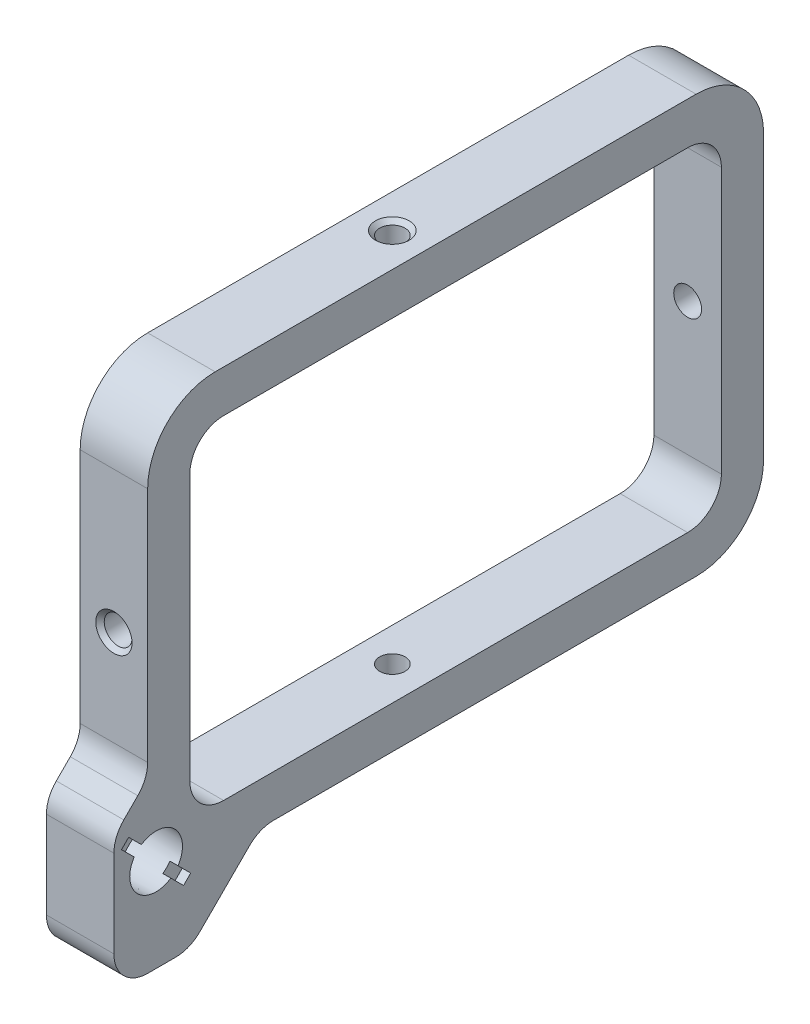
ISO-10303-21;
HEADER;
FILE_DESCRIPTION(('STEP AP214'),'2;1');
FILE_NAME('part.step','',(''),(''),'','','');
FILE_SCHEMA(('AUTOMOTIVE_DESIGN { 1 0 10303 214 1 1 1 1 }'));
ENDSEC;
DATA;
#1=APPLICATION_CONTEXT('core data for automotive mechanical design processes');
#2=APPLICATION_PROTOCOL_DEFINITION('international standard','automotive_design',2000,#1);
#3=PRODUCT_CONTEXT('',#1,'mechanical');
#4=PRODUCT('Part','Part','',(#3));
#5=PRODUCT_RELATED_PRODUCT_CATEGORY('part','',(#4));
#6=PRODUCT_DEFINITION_FORMATION('','',#4);
#7=PRODUCT_DEFINITION_CONTEXT('part definition',#1,'design');
#8=PRODUCT_DEFINITION('design','',#6,#7);
#9=PRODUCT_DEFINITION_SHAPE('','',#8);
#10=(LENGTH_UNIT() NAMED_UNIT(*) SI_UNIT(.MILLI.,.METRE.));
#11=(NAMED_UNIT(*) PLANE_ANGLE_UNIT() SI_UNIT($,.RADIAN.));
#12=(NAMED_UNIT(*) SI_UNIT($,.STERADIAN.) SOLID_ANGLE_UNIT());
#13=UNCERTAINTY_MEASURE_WITH_UNIT(LENGTH_MEASURE(1.E-05),#10,'distance_accuracy_value','');
#14=(GEOMETRIC_REPRESENTATION_CONTEXT(3) GLOBAL_UNCERTAINTY_ASSIGNED_CONTEXT((#13)) GLOBAL_UNIT_ASSIGNED_CONTEXT((#10,
#11,#12)) REPRESENTATION_CONTEXT('',''));
#15=CARTESIAN_POINT('',(0.,0.,0.));
#16=DIRECTION('',(0.,0.,1.));
#17=DIRECTION('',(1.,0.,0.));
#18=AXIS2_PLACEMENT_3D('',#15,#16,#17);
#19=CARTESIAN_POINT('',(8.,0.,0.));
#20=DIRECTION('',(1.,0.,0.));
#21=DIRECTION('',(0.,0.,-1.));
#22=AXIS2_PLACEMENT_3D('',#19,#20,#21);
#23=PLANE('',#22);
#24=DIRECTION('',(0.,0.707106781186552,0.707106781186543));
#25=VECTOR('',#24,1.);
#26=CARTESIAN_POINT('',(8.,-17.898780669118,75.2526911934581));
#27=LINE('',#26,#25);
#28=CARTESIAN_POINT('',(8.,-25.2526911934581,67.898780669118));
#29=VERTEX_POINT('',#28);
#30=CARTESIAN_POINT('',(8.,-23.7443328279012,69.407139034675));
#31=VERTEX_POINT('',#30);
#32=EDGE_CURVE('E285',#29,#31,#27,.T.);
#33=ORIENTED_EDGE('',*,*,#32,.F.);
#34=DIRECTION('',(0.,0.707106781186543,-0.707106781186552));
#35=VECTOR('',#34,1.);
#36=CARTESIAN_POINT('',(8.,-25.2526911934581,67.898780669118));
#37=LINE('',#36,#35);
#38=CARTESIAN_POINT('',(8.,-26.101219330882,68.7473088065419));
#39=VERTEX_POINT('',#38);
#40=EDGE_CURVE('E263',#39,#29,#37,.T.);
#41=ORIENTED_EDGE('',*,*,#40,.F.);
#42=DIRECTION('',(0.,-0.707106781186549,-0.707106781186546));
#43=VECTOR('',#42,1.);
#44=CARTESIAN_POINT('',(8.,-26.101219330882,68.7473088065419));
#45=LINE('',#44,#43);
#46=CARTESIAN_POINT('',(8.,-24.592860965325,70.2556671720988));
#47=VERTEX_POINT('',#46);
#48=EDGE_CURVE('E290',#47,#39,#45,.T.);
#49=ORIENTED_EDGE('',*,*,#48,.F.);
#50=CARTESIAN_POINT('',(8.,-22.,72.));
#51=DIRECTION('',(1.,0.,0.));
#52=DIRECTION('',(0.,0.,-1.));
#53=AXIS2_PLACEMENT_3D('',#50,#51,#52);
#54=CIRCLE('',#53,3.125);
#55=CARTESIAN_POINT('',(8.,-20.2556671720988,74.592860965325));
#56=VERTEX_POINT('',#55);
#57=EDGE_CURVE('E312',#56,#47,#54,.T.);
#58=ORIENTED_EDGE('',*,*,#57,.F.);
#59=CARTESIAN_POINT('',(8.,-18.7473088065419,76.101219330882));
#60=VERTEX_POINT('',#59);
#61=EDGE_CURVE('E291',#60,#56,#45,.T.);
#62=ORIENTED_EDGE('',*,*,#61,.F.);
#63=DIRECTION('',(0.,-0.707106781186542,0.707106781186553));
#64=VECTOR('',#63,1.);
#65=CARTESIAN_POINT('',(8.,-18.7473088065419,76.101219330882));
#66=LINE('',#65,#64);
#67=CARTESIAN_POINT('',(8.,-17.898780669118,75.2526911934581));
#68=VERTEX_POINT('',#67);
#69=EDGE_CURVE('E288',#68,#60,#66,.T.);
#70=ORIENTED_EDGE('',*,*,#69,.F.);
#71=CARTESIAN_POINT('',(8.,-19.4071390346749,73.7443328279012));
#72=VERTEX_POINT('',#71);
#73=EDGE_CURVE('E269',#72,#68,#27,.T.);
#74=ORIENTED_EDGE('',*,*,#73,.F.);
#75=EDGE_CURVE('E309',#31,#72,#54,.T.);
#76=ORIENTED_EDGE('',*,*,#75,.F.);
#77=EDGE_LOOP('',(#33,#41,#49,#58,#62,#70,#74,#76));
#78=FACE_BOUND('',#77,.T.);
#79=DIRECTION('',(0.,-1.,0.));
#80=VECTOR('',#79,1.);
#81=CARTESIAN_POINT('',(8.,19.75,68.));
#82=LINE('',#81,#80);
#83=CARTESIAN_POINT('',(8.,15.75,68.));
#84=VERTEX_POINT('',#83);
#85=CARTESIAN_POINT('',(8.,-15.75,68.));
#86=VERTEX_POINT('',#85);
#87=EDGE_CURVE('E316',#84,#86,#82,.T.);
#88=ORIENTED_EDGE('',*,*,#87,.F.);
#89=CARTESIAN_POINT('',(8.,15.75,64.));
#90=DIRECTION('',(1.,0.,0.));
#91=DIRECTION('',(0.,0.,-1.));
#92=AXIS2_PLACEMENT_3D('',#89,#90,#91);
#93=CIRCLE('',#92,4.);
#94=CARTESIAN_POINT('',(8.,19.75,64.));
#95=VERTEX_POINT('',#94);
#96=EDGE_CURVE('E519',#84,#95,#93,.F.);
#97=ORIENTED_EDGE('',*,*,#96,.T.);
#98=DIRECTION('',(0.,0.,1.));
#99=VECTOR('',#98,1.);
#100=CARTESIAN_POINT('',(8.,19.75,5.));
#101=LINE('',#100,#99);
#102=CARTESIAN_POINT('',(8.,19.75,9.));
#103=VERTEX_POINT('',#102);
#104=EDGE_CURVE('E313',#103,#95,#101,.T.);
#105=ORIENTED_EDGE('',*,*,#104,.F.);
#106=CARTESIAN_POINT('',(8.,15.75,9.));
#107=DIRECTION('',(1.,0.,0.));
#108=DIRECTION('',(0.,0.,-1.));
#109=AXIS2_PLACEMENT_3D('',#106,#107,#108);
#110=CIRCLE('',#109,4.);
#111=CARTESIAN_POINT('',(8.,15.75,5.));
#112=VERTEX_POINT('',#111);
#113=EDGE_CURVE('E515',#103,#112,#110,.F.);
#114=ORIENTED_EDGE('',*,*,#113,.T.);
#115=DIRECTION('',(0.,1.,0.));
#116=VECTOR('',#115,1.);
#117=CARTESIAN_POINT('',(8.,-19.75,5.));
#118=LINE('',#117,#116);
#119=CARTESIAN_POINT('',(8.,-15.75,5.));
#120=VERTEX_POINT('',#119);
#121=EDGE_CURVE('E323',#120,#112,#118,.T.);
#122=ORIENTED_EDGE('',*,*,#121,.F.);
#123=CARTESIAN_POINT('',(8.,-15.75,9.));
#124=DIRECTION('',(1.,0.,0.));
#125=DIRECTION('',(0.,0.,-1.));
#126=AXIS2_PLACEMENT_3D('',#123,#124,#125);
#127=CIRCLE('',#126,4.);
#128=CARTESIAN_POINT('',(8.,-19.75,9.));
#129=VERTEX_POINT('',#128);
#130=EDGE_CURVE('E511',#120,#129,#127,.F.);
#131=ORIENTED_EDGE('',*,*,#130,.T.);
#132=DIRECTION('',(0.,0.,-1.));
#133=VECTOR('',#132,1.);
#134=CARTESIAN_POINT('',(8.,-19.75,68.));
#135=LINE('',#134,#133);
#136=CARTESIAN_POINT('',(8.,-19.75,64.));
#137=VERTEX_POINT('',#136);
#138=EDGE_CURVE('E320',#137,#129,#135,.T.);
#139=ORIENTED_EDGE('',*,*,#138,.F.);
#140=CARTESIAN_POINT('',(8.,-15.75,64.));
#141=DIRECTION('',(1.,0.,0.));
#142=DIRECTION('',(0.,0.,-1.));
#143=AXIS2_PLACEMENT_3D('',#140,#141,#142);
#144=CIRCLE('',#143,4.);
#145=EDGE_CURVE('E507',#137,#86,#144,.F.);
#146=ORIENTED_EDGE('',*,*,#145,.T.);
#147=EDGE_LOOP('',(#88,#97,#105,#114,#122,#131,#139,#146));
#148=FACE_BOUND('',#147,.T.);
#149=DIRECTION('',(0.,0.,-1.));
#150=VECTOR('',#149,1.);
#151=CARTESIAN_POINT('',(8.,-24.75,59.75));
#152=LINE('',#151,#150);
#153=CARTESIAN_POINT('',(8.,-24.75,58.0931457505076));
#154=VERTEX_POINT('',#153);
#155=CARTESIAN_POINT('',(8.,-24.75,8.));
#156=VERTEX_POINT('',#155);
#157=EDGE_CURVE('E351',#154,#156,#152,.T.);
#158=ORIENTED_EDGE('',*,*,#157,.T.);
#159=CARTESIAN_POINT('',(8.,-16.75,8.));
#160=DIRECTION('',(1.,0.,0.));
#161=DIRECTION('',(0.,0.,-1.));
#162=AXIS2_PLACEMENT_3D('',#159,#160,#161);
#163=CIRCLE('',#162,8.);
#164=CARTESIAN_POINT('',(8.,-16.75,0.));
#165=VERTEX_POINT('',#164);
#166=EDGE_CURVE('E475',#156,#165,#163,.T.);
#167=ORIENTED_EDGE('',*,*,#166,.T.);
#168=DIRECTION('',(0.,1.,0.));
#169=VECTOR('',#168,1.);
#170=CARTESIAN_POINT('',(8.,-24.75,0.));
#171=LINE('',#170,#169);
#172=CARTESIAN_POINT('',(8.,16.75,0.));
#173=VERTEX_POINT('',#172);
#174=EDGE_CURVE('E354',#165,#173,#171,.T.);
#175=ORIENTED_EDGE('',*,*,#174,.T.);
#176=CARTESIAN_POINT('',(8.,16.75,8.));
#177=DIRECTION('',(1.,0.,0.));
#178=DIRECTION('',(0.,0.,-1.));
#179=AXIS2_PLACEMENT_3D('',#176,#177,#178);
#180=CIRCLE('',#179,8.);
#181=CARTESIAN_POINT('',(8.,24.75,8.));
#182=VERTEX_POINT('',#181);
#183=EDGE_CURVE('E473',#173,#182,#180,.T.);
#184=ORIENTED_EDGE('',*,*,#183,.T.);
#185=DIRECTION('',(0.,0.,1.));
#186=VECTOR('',#185,1.);
#187=CARTESIAN_POINT('',(8.,24.75,0.));
#188=LINE('',#187,#186);
#189=CARTESIAN_POINT('',(8.,24.75,65.));
#190=VERTEX_POINT('',#189);
#191=EDGE_CURVE('E357',#182,#190,#188,.T.);
#192=ORIENTED_EDGE('',*,*,#191,.T.);
#193=CARTESIAN_POINT('',(8.,16.75,65.));
#194=DIRECTION('',(1.,0.,0.));
#195=DIRECTION('',(0.,0.,-1.));
#196=AXIS2_PLACEMENT_3D('',#193,#194,#195);
#197=CIRCLE('',#196,8.);
#198=CARTESIAN_POINT('',(8.,16.75,73.));
#199=VERTEX_POINT('',#198);
#200=EDGE_CURVE('E471',#190,#199,#197,.T.);
#201=ORIENTED_EDGE('',*,*,#200,.T.);
#202=DIRECTION('',(0.,-1.,0.));
#203=VECTOR('',#202,1.);
#204=CARTESIAN_POINT('',(8.,24.75,73.));
#205=LINE('',#204,#203);
#206=CARTESIAN_POINT('',(8.,-11.3431457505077,73.));
#207=VERTEX_POINT('',#206);
#208=EDGE_CURVE('E360',#199,#207,#205,.T.);
#209=ORIENTED_EDGE('',*,*,#208,.T.);
#210=CARTESIAN_POINT('',(8.,-11.3431457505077,77.));
#211=DIRECTION('',(1.,0.,0.));
#212=DIRECTION('',(0.,0.,-1.));
#213=AXIS2_PLACEMENT_3D('',#210,#211,#212);
#214=CIRCLE('',#213,4.);
#215=CARTESIAN_POINT('',(8.,-14.1715728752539,74.1715728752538));
#216=VERTEX_POINT('',#215);
#217=EDGE_CURVE('E456',#207,#216,#214,.F.);
#218=ORIENTED_EDGE('',*,*,#217,.T.);
#219=DIRECTION('',(0.,-0.707106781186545,0.707106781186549));
#220=VECTOR('',#219,1.);
#221=CARTESIAN_POINT('',(8.,-13.,73.));
#222=LINE('',#221,#220);
#223=CARTESIAN_POINT('',(8.,-15.8284271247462,75.8284271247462));
#224=VERTEX_POINT('',#223);
#225=EDGE_CURVE('E338',#216,#224,#222,.T.);
#226=ORIENTED_EDGE('',*,*,#225,.T.);
#227=CARTESIAN_POINT('',(8.,-18.6568542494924,73.));
#228=DIRECTION('',(1.,0.,0.));
#229=DIRECTION('',(0.,0.,-1.));
#230=AXIS2_PLACEMENT_3D('',#227,#228,#229);
#231=CIRCLE('',#230,4.);
#232=CARTESIAN_POINT('',(8.,-18.6568542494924,77.));
#233=VERTEX_POINT('',#232);
#234=EDGE_CURVE('E427',#224,#233,#231,.T.);
#235=ORIENTED_EDGE('',*,*,#234,.T.);
#236=DIRECTION('',(0.,-1.,0.));
#237=VECTOR('',#236,1.);
#238=CARTESIAN_POINT('',(8.,-17.,77.));
#239=LINE('',#238,#237);
#240=CARTESIAN_POINT('',(8.,-29.,77.));
#241=VERTEX_POINT('',#240);
#242=EDGE_CURVE('E341',#233,#241,#239,.T.);
#243=ORIENTED_EDGE('',*,*,#242,.T.);
#244=CARTESIAN_POINT('',(8.,-29.,73.));
#245=DIRECTION('',(1.,0.,0.));
#246=DIRECTION('',(0.,0.,-1.));
#247=AXIS2_PLACEMENT_3D('',#244,#245,#246);
#248=CIRCLE('',#247,4.);
#249=CARTESIAN_POINT('',(8.,-33.,73.));
#250=VERTEX_POINT('',#249);
#251=EDGE_CURVE('E429',#241,#250,#248,.T.);
#252=ORIENTED_EDGE('',*,*,#251,.T.);
#253=DIRECTION('',(0.,0.,-1.));
#254=VECTOR('',#253,1.);
#255=CARTESIAN_POINT('',(8.,-33.,77.));
#256=LINE('',#255,#254);
#257=CARTESIAN_POINT('',(8.,-33.,69.6568542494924));
#258=VERTEX_POINT('',#257);
#259=EDGE_CURVE('E345',#250,#258,#256,.T.);
#260=ORIENTED_EDGE('',*,*,#259,.T.);
#261=CARTESIAN_POINT('',(8.,-29.,69.6568542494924));
#262=DIRECTION('',(1.,0.,0.));
#263=DIRECTION('',(0.,0.,-1.));
#264=AXIS2_PLACEMENT_3D('',#261,#262,#263);
#265=CIRCLE('',#264,4.);
#266=CARTESIAN_POINT('',(8.,-31.8284271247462,66.8284271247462));
#267=VERTEX_POINT('',#266);
#268=EDGE_CURVE('E431',#258,#267,#265,.T.);
#269=ORIENTED_EDGE('',*,*,#268,.T.);
#270=DIRECTION('',(0.,0.707106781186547,-0.707106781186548));
#271=VECTOR('',#270,1.);
#272=CARTESIAN_POINT('',(8.,-33.,68.));
#273=LINE('',#272,#271);
#274=CARTESIAN_POINT('',(8.,-25.9215728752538,60.9215728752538));
#275=VERTEX_POINT('',#274);
#276=EDGE_CURVE('E348',#267,#275,#273,.T.);
#277=ORIENTED_EDGE('',*,*,#276,.T.);
#278=CARTESIAN_POINT('',(8.,-28.75,58.0931457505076));
#279=DIRECTION('',(1.,0.,0.));
#280=DIRECTION('',(0.,0.,-1.));
#281=AXIS2_PLACEMENT_3D('',#278,#279,#280);
#282=CIRCLE('',#281,4.);
#283=EDGE_CURVE('E451',#275,#154,#282,.F.);
#284=ORIENTED_EDGE('',*,*,#283,.T.);
#285=EDGE_LOOP('',(#158,#167,#175,#184,#192,#201,#209,#218,#226,#235,#243,#252,#260,#269,#277,#284));
#286=FACE_BOUND('',#285,.T.);
#287=ADVANCED_FACE('F42',(#78,#148,#286),#23,.T.);
#288=CARTESIAN_POINT('',(0.,0.,0.));
#289=DIRECTION('',(1.,0.,0.));
#290=DIRECTION('',(0.,0.,-1.));
#291=AXIS2_PLACEMENT_3D('',#288,#289,#290);
#292=PLANE('',#291);
#293=CARTESIAN_POINT('',(0.,-22.,72.));
#294=DIRECTION('',(1.,0.,0.));
#295=DIRECTION('',(0.,0.,-1.));
#296=AXIS2_PLACEMENT_3D('',#293,#294,#295);
#297=CIRCLE('',#296,3.62499999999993);
#298=CARTESIAN_POINT('',(0.,-22.,68.3750000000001));
#299=VERTEX_POINT('',#298);
#300=EDGE_CURVE('E521',#299,#299,#297,.T.);
#301=ORIENTED_EDGE('',*,*,#300,.T.);
#302=EDGE_LOOP('',(#301));
#303=FACE_BOUND('',#302,.T.);
#304=DIRECTION('',(0.,1.,0.));
#305=VECTOR('',#304,1.);
#306=CARTESIAN_POINT('',(0.,-24.75,0.));
#307=LINE('',#306,#305);
#308=CARTESIAN_POINT('',(0.,-16.75,0.));
#309=VERTEX_POINT('',#308);
#310=CARTESIAN_POINT('',(0.,16.75,0.));
#311=VERTEX_POINT('',#310);
#312=EDGE_CURVE('E377',#309,#311,#307,.T.);
#313=ORIENTED_EDGE('',*,*,#312,.F.);
#314=CARTESIAN_POINT('',(0.,-16.75,8.));
#315=DIRECTION('',(1.,0.,0.));
#316=DIRECTION('',(0.,0.,-1.));
#317=AXIS2_PLACEMENT_3D('',#314,#315,#316);
#318=CIRCLE('',#317,8.);
#319=CARTESIAN_POINT('',(0.,-24.75,8.));
#320=VERTEX_POINT('',#319);
#321=EDGE_CURVE('E467',#309,#320,#318,.F.);
#322=ORIENTED_EDGE('',*,*,#321,.T.);
#323=DIRECTION('',(0.,0.,-1.));
#324=VECTOR('',#323,1.);
#325=CARTESIAN_POINT('',(0.,-24.75,59.75));
#326=LINE('',#325,#324);
#327=CARTESIAN_POINT('',(0.,-24.75,58.0931457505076));
#328=VERTEX_POINT('',#327);
#329=EDGE_CURVE('E374',#328,#320,#326,.T.);
#330=ORIENTED_EDGE('',*,*,#329,.F.);
#331=CARTESIAN_POINT('',(0.,-28.75,58.0931457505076));
#332=DIRECTION('',(1.,0.,0.));
#333=DIRECTION('',(0.,0.,-1.));
#334=AXIS2_PLACEMENT_3D('',#331,#332,#333);
#335=CIRCLE('',#334,4.);
#336=CARTESIAN_POINT('',(0.,-25.9215728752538,60.9215728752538));
#337=VERTEX_POINT('',#336);
#338=EDGE_CURVE('E449',#328,#337,#335,.T.);
#339=ORIENTED_EDGE('',*,*,#338,.T.);
#340=DIRECTION('',(0.,0.707106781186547,-0.707106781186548));
#341=VECTOR('',#340,1.);
#342=CARTESIAN_POINT('',(0.,-33.,68.));
#343=LINE('',#342,#341);
#344=CARTESIAN_POINT('',(0.,-31.8284271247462,66.8284271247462));
#345=VERTEX_POINT('',#344);
#346=EDGE_CURVE('E371',#345,#337,#343,.T.);
#347=ORIENTED_EDGE('',*,*,#346,.F.);
#348=CARTESIAN_POINT('',(0.,-29.,69.6568542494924));
#349=DIRECTION('',(1.,0.,0.));
#350=DIRECTION('',(0.,0.,-1.));
#351=AXIS2_PLACEMENT_3D('',#348,#349,#350);
#352=CIRCLE('',#351,4.);
#353=CARTESIAN_POINT('',(0.,-33.,69.6568542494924));
#354=VERTEX_POINT('',#353);
#355=EDGE_CURVE('E420',#345,#354,#352,.F.);
#356=ORIENTED_EDGE('',*,*,#355,.T.);
#357=DIRECTION('',(0.,0.,-1.));
#358=VECTOR('',#357,1.);
#359=CARTESIAN_POINT('',(0.,-33.,77.));
#360=LINE('',#359,#358);
#361=CARTESIAN_POINT('',(0.,-33.,73.));
#362=VERTEX_POINT('',#361);
#363=EDGE_CURVE('E368',#362,#354,#360,.T.);
#364=ORIENTED_EDGE('',*,*,#363,.F.);
#365=CARTESIAN_POINT('',(0.,-29.,73.));
#366=DIRECTION('',(1.,0.,0.));
#367=DIRECTION('',(0.,0.,-1.));
#368=AXIS2_PLACEMENT_3D('',#365,#366,#367);
#369=CIRCLE('',#368,4.);
#370=CARTESIAN_POINT('',(0.,-29.,77.));
#371=VERTEX_POINT('',#370);
#372=EDGE_CURVE('E418',#362,#371,#369,.F.);
#373=ORIENTED_EDGE('',*,*,#372,.T.);
#374=DIRECTION('',(0.,-1.,0.));
#375=VECTOR('',#374,1.);
#376=CARTESIAN_POINT('',(0.,-17.,77.));
#377=LINE('',#376,#375);
#378=CARTESIAN_POINT('',(0.,-18.6568542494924,77.));
#379=VERTEX_POINT('',#378);
#380=EDGE_CURVE('E365',#379,#371,#377,.T.);
#381=ORIENTED_EDGE('',*,*,#380,.F.);
#382=CARTESIAN_POINT('',(0.,-18.6568542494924,73.));
#383=DIRECTION('',(1.,0.,0.));
#384=DIRECTION('',(0.,0.,-1.));
#385=AXIS2_PLACEMENT_3D('',#382,#383,#384);
#386=CIRCLE('',#385,4.);
#387=CARTESIAN_POINT('',(0.,-15.8284271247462,75.8284271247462));
#388=VERTEX_POINT('',#387);
#389=EDGE_CURVE('E416',#379,#388,#386,.F.);
#390=ORIENTED_EDGE('',*,*,#389,.T.);
#391=DIRECTION('',(0.,-0.707106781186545,0.707106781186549));
#392=VECTOR('',#391,1.);
#393=CARTESIAN_POINT('',(0.,-13.,73.));
#394=LINE('',#393,#392);
#395=CARTESIAN_POINT('',(0.,-14.1715728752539,74.1715728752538));
#396=VERTEX_POINT('',#395);
#397=EDGE_CURVE('E326',#396,#388,#394,.T.);
#398=ORIENTED_EDGE('',*,*,#397,.F.);
#399=CARTESIAN_POINT('',(0.,-11.3431457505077,77.));
#400=DIRECTION('',(1.,0.,0.));
#401=DIRECTION('',(0.,0.,-1.));
#402=AXIS2_PLACEMENT_3D('',#399,#400,#401);
#403=CIRCLE('',#402,4.);
#404=CARTESIAN_POINT('',(0.,-11.3431457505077,73.));
#405=VERTEX_POINT('',#404);
#406=EDGE_CURVE('E453',#396,#405,#403,.T.);
#407=ORIENTED_EDGE('',*,*,#406,.T.);
#408=DIRECTION('',(0.,-1.,0.));
#409=VECTOR('',#408,1.);
#410=CARTESIAN_POINT('',(0.,24.75,73.));
#411=LINE('',#410,#409);
#412=CARTESIAN_POINT('',(0.,16.75,73.));
#413=VERTEX_POINT('',#412);
#414=EDGE_CURVE('E342',#413,#405,#411,.T.);
#415=ORIENTED_EDGE('',*,*,#414,.F.);
#416=CARTESIAN_POINT('',(0.,16.75,65.));
#417=DIRECTION('',(1.,0.,0.));
#418=DIRECTION('',(0.,0.,-1.));
#419=AXIS2_PLACEMENT_3D('',#416,#417,#418);
#420=CIRCLE('',#419,8.);
#421=CARTESIAN_POINT('',(0.,24.75,65.));
#422=VERTEX_POINT('',#421);
#423=EDGE_CURVE('E463',#413,#422,#420,.F.);
#424=ORIENTED_EDGE('',*,*,#423,.T.);
#425=DIRECTION('',(0.,0.,1.));
#426=VECTOR('',#425,1.);
#427=CARTESIAN_POINT('',(0.,24.75,0.));
#428=LINE('',#427,#426);
#429=CARTESIAN_POINT('',(0.,24.75,8.));
#430=VERTEX_POINT('',#429);
#431=EDGE_CURVE('E380',#430,#422,#428,.T.);
#432=ORIENTED_EDGE('',*,*,#431,.F.);
#433=CARTESIAN_POINT('',(0.,16.75,8.));
#434=DIRECTION('',(1.,0.,0.));
#435=DIRECTION('',(0.,0.,-1.));
#436=AXIS2_PLACEMENT_3D('',#433,#434,#435);
#437=CIRCLE('',#436,8.);
#438=EDGE_CURVE('E465',#430,#311,#437,.F.);
#439=ORIENTED_EDGE('',*,*,#438,.T.);
#440=EDGE_LOOP('',(#313,#322,#330,#339,#347,#356,#364,#373,#381,#390,#398,#407,#415,#424,#432,#439));
#441=FACE_BOUND('',#440,.T.);
#442=DIRECTION('',(0.,1.,0.));
#443=VECTOR('',#442,1.);
#444=CARTESIAN_POINT('',(0.,-19.75,5.));
#445=LINE('',#444,#443);
#446=CARTESIAN_POINT('',(0.,-15.75,5.));
#447=VERTEX_POINT('',#446);
#448=CARTESIAN_POINT('',(0.,15.75,5.));
#449=VERTEX_POINT('',#448);
#450=EDGE_CURVE('E317',#447,#449,#445,.T.);
#451=ORIENTED_EDGE('',*,*,#450,.T.);
#452=CARTESIAN_POINT('',(0.,15.75,9.));
#453=DIRECTION('',(1.,0.,0.));
#454=DIRECTION('',(0.,0.,-1.));
#455=AXIS2_PLACEMENT_3D('',#452,#453,#454);
#456=CIRCLE('',#455,4.);
#457=CARTESIAN_POINT('',(0.,19.75,9.));
#458=VERTEX_POINT('',#457);
#459=EDGE_CURVE('E513',#449,#458,#456,.T.);
#460=ORIENTED_EDGE('',*,*,#459,.T.);
#461=DIRECTION('',(0.,0.,1.));
#462=VECTOR('',#461,1.);
#463=CARTESIAN_POINT('',(0.,19.75,5.));
#464=LINE('',#463,#462);
#465=CARTESIAN_POINT('',(0.,19.75,64.));
#466=VERTEX_POINT('',#465);
#467=EDGE_CURVE('E327',#458,#466,#464,.T.);
#468=ORIENTED_EDGE('',*,*,#467,.T.);
#469=CARTESIAN_POINT('',(0.,15.75,64.));
#470=DIRECTION('',(1.,0.,0.));
#471=DIRECTION('',(0.,0.,-1.));
#472=AXIS2_PLACEMENT_3D('',#469,#470,#471);
#473=CIRCLE('',#472,4.);
#474=CARTESIAN_POINT('',(0.,15.75,68.));
#475=VERTEX_POINT('',#474);
#476=EDGE_CURVE('E517',#466,#475,#473,.T.);
#477=ORIENTED_EDGE('',*,*,#476,.T.);
#478=DIRECTION('',(0.,-1.,0.));
#479=VECTOR('',#478,1.);
#480=CARTESIAN_POINT('',(0.,19.75,68.));
#481=LINE('',#480,#479);
#482=CARTESIAN_POINT('',(0.,-15.75,68.));
#483=VERTEX_POINT('',#482);
#484=EDGE_CURVE('E330',#475,#483,#481,.T.);
#485=ORIENTED_EDGE('',*,*,#484,.T.);
#486=CARTESIAN_POINT('',(0.,-15.75,64.));
#487=DIRECTION('',(1.,0.,0.));
#488=DIRECTION('',(0.,0.,-1.));
#489=AXIS2_PLACEMENT_3D('',#486,#487,#488);
#490=CIRCLE('',#489,4.);
#491=CARTESIAN_POINT('',(0.,-19.75,64.));
#492=VERTEX_POINT('',#491);
#493=EDGE_CURVE('E505',#483,#492,#490,.T.);
#494=ORIENTED_EDGE('',*,*,#493,.T.);
#495=DIRECTION('',(0.,0.,-1.));
#496=VECTOR('',#495,1.);
#497=CARTESIAN_POINT('',(0.,-19.75,68.));
#498=LINE('',#497,#496);
#499=CARTESIAN_POINT('',(0.,-19.75,9.));
#500=VERTEX_POINT('',#499);
#501=EDGE_CURVE('E333',#492,#500,#498,.T.);
#502=ORIENTED_EDGE('',*,*,#501,.T.);
#503=CARTESIAN_POINT('',(0.,-15.75,9.));
#504=DIRECTION('',(1.,0.,0.));
#505=DIRECTION('',(0.,0.,-1.));
#506=AXIS2_PLACEMENT_3D('',#503,#504,#505);
#507=CIRCLE('',#506,4.);
#508=EDGE_CURVE('E509',#500,#447,#507,.T.);
#509=ORIENTED_EDGE('',*,*,#508,.T.);
#510=EDGE_LOOP('',(#451,#460,#468,#477,#485,#494,#502,#509));
#511=FACE_BOUND('',#510,.T.);
#512=ADVANCED_FACE('F568',(#303,#441,#511),#292,.F.);
#513=CARTESIAN_POINT('',(8.,-13.,73.));
#514=DIRECTION('',(0.,-0.70710678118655,-0.707106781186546));
#515=DIRECTION('',(0.,0.707106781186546,-0.70710678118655));
#516=AXIS2_PLACEMENT_3D('',#513,#514,#515);
#517=PLANE('',#516);
#518=ORIENTED_EDGE('',*,*,#397,.T.);
#519=DIRECTION('',(-1.,0.,0.));
#520=VECTOR('',#519,1.);
#521=CARTESIAN_POINT('',(8.,-15.8284271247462,75.8284271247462));
#522=LINE('',#521,#520);
#523=EDGE_CURVE('E444',#388,#224,#522,.F.);
#524=ORIENTED_EDGE('',*,*,#523,.T.);
#525=ORIENTED_EDGE('',*,*,#225,.F.);
#526=DIRECTION('',(-1.,0.,0.));
#527=VECTOR('',#526,1.);
#528=CARTESIAN_POINT('',(0.,-14.1715728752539,74.1715728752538));
#529=LINE('',#528,#527);
#530=EDGE_CURVE('E441',#216,#396,#529,.T.);
#531=ORIENTED_EDGE('',*,*,#530,.T.);
#532=EDGE_LOOP('',(#518,#524,#525,#531));
#533=FACE_BOUND('',#532,.T.);
#534=ADVANCED_FACE('F572',(#533),#517,.F.);
#535=CARTESIAN_POINT('',(8.,-17.,77.));
#536=DIRECTION('',(0.,0.,-1.));
#537=DIRECTION('',(-1.,0.,0.));
#538=AXIS2_PLACEMENT_3D('',#535,#536,#537);
#539=PLANE('',#538);
#540=ORIENTED_EDGE('',*,*,#380,.T.);
#541=DIRECTION('',(-1.,0.,0.));
#542=VECTOR('',#541,1.);
#543=CARTESIAN_POINT('',(8.,-29.,77.));
#544=LINE('',#543,#542);
#545=EDGE_CURVE('E439',#371,#241,#544,.F.);
#546=ORIENTED_EDGE('',*,*,#545,.T.);
#547=ORIENTED_EDGE('',*,*,#242,.F.);
#548=DIRECTION('',(-1.,0.,0.));
#549=VECTOR('',#548,1.);
#550=CARTESIAN_POINT('',(8.,-18.6568542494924,77.));
#551=LINE('',#550,#549);
#552=EDGE_CURVE('E436',#233,#379,#551,.T.);
#553=ORIENTED_EDGE('',*,*,#552,.T.);
#554=EDGE_LOOP('',(#540,#546,#547,#553));
#555=FACE_BOUND('',#554,.T.);
#556=ADVANCED_FACE('F596',(#555),#539,.F.);
#557=CARTESIAN_POINT('',(8.,-33.,77.));
#558=DIRECTION('',(0.,1.,0.));
#559=DIRECTION('',(0.,0.,1.));
#560=AXIS2_PLACEMENT_3D('',#557,#558,#559);
#561=PLANE('',#560);
#562=ORIENTED_EDGE('',*,*,#363,.T.);
#563=DIRECTION('',(-1.,0.,0.));
#564=VECTOR('',#563,1.);
#565=CARTESIAN_POINT('',(8.,-33.,69.6568542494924));
#566=LINE('',#565,#564);
#567=EDGE_CURVE('E425',#354,#258,#566,.F.);
#568=ORIENTED_EDGE('',*,*,#567,.T.);
#569=ORIENTED_EDGE('',*,*,#259,.F.);
#570=DIRECTION('',(-1.,0.,0.));
#571=VECTOR('',#570,1.);
#572=CARTESIAN_POINT('',(8.,-33.,73.));
#573=LINE('',#572,#571);
#574=EDGE_CURVE('E422',#250,#362,#573,.T.);
#575=ORIENTED_EDGE('',*,*,#574,.T.);
#576=EDGE_LOOP('',(#562,#568,#569,#575));
#577=FACE_BOUND('',#576,.T.);
#578=ADVANCED_FACE('F592',(#577),#561,.F.);
#579=CARTESIAN_POINT('',(8.,-33.,68.));
#580=DIRECTION('',(0.,0.707106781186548,0.707106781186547));
#581=DIRECTION('',(0.,-0.707106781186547,0.707106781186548));
#582=AXIS2_PLACEMENT_3D('',#579,#580,#581);
#583=PLANE('',#582);
#584=ORIENTED_EDGE('',*,*,#276,.F.);
#585=DIRECTION('',(-1.,0.,0.));
#586=VECTOR('',#585,1.);
#587=CARTESIAN_POINT('',(8.,-31.8284271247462,66.8284271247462));
#588=LINE('',#587,#586);
#589=EDGE_CURVE('E413',#267,#345,#588,.T.);
#590=ORIENTED_EDGE('',*,*,#589,.T.);
#591=ORIENTED_EDGE('',*,*,#346,.T.);
#592=DIRECTION('',(-1.,0.,0.));
#593=VECTOR('',#592,1.);
#594=CARTESIAN_POINT('',(8.,-25.9215728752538,60.9215728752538));
#595=LINE('',#594,#593);
#596=EDGE_CURVE('E411',#337,#275,#595,.F.);
#597=ORIENTED_EDGE('',*,*,#596,.T.);
#598=EDGE_LOOP('',(#584,#590,#591,#597));
#599=FACE_BOUND('',#598,.T.);
#600=ADVANCED_FACE('F588',(#599),#583,.F.);
#601=CARTESIAN_POINT('',(8.,-24.75,59.75));
#602=DIRECTION('',(0.,1.,0.));
#603=DIRECTION('',(0.,0.,1.));
#604=AXIS2_PLACEMENT_3D('',#601,#602,#603);
#605=PLANE('',#604);
#606=CARTESIAN_POINT('',(4.,-24.75,40.));
#607=DIRECTION('',(0.,1.,0.));
#608=DIRECTION('',(0.,0.,1.));
#609=AXIS2_PLACEMENT_3D('',#606,#607,#608);
#610=CIRCLE('',#609,2.);
#611=CARTESIAN_POINT('',(4.,-24.75,42.));
#612=VERTEX_POINT('',#611);
#613=EDGE_CURVE('E408',#612,#612,#610,.T.);
#614=ORIENTED_EDGE('',*,*,#613,.T.);
#615=EDGE_LOOP('',(#614));
#616=FACE_BOUND('',#615,.T.);
#617=ORIENTED_EDGE('',*,*,#329,.T.);
#618=DIRECTION('',(-1.,0.,0.));
#619=VECTOR('',#618,1.);
#620=CARTESIAN_POINT('',(8.,-24.75,8.));
#621=LINE('',#620,#619);
#622=EDGE_CURVE('E469',#320,#156,#621,.F.);
#623=ORIENTED_EDGE('',*,*,#622,.T.);
#624=ORIENTED_EDGE('',*,*,#157,.F.);
#625=DIRECTION('',(-1.,0.,0.));
#626=VECTOR('',#625,1.);
#627=CARTESIAN_POINT('',(0.,-24.75,58.0931457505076));
#628=LINE('',#627,#626);
#629=EDGE_CURVE('E433',#154,#328,#628,.T.);
#630=ORIENTED_EDGE('',*,*,#629,.T.);
#631=EDGE_LOOP('',(#617,#623,#624,#630));
#632=FACE_BOUND('',#631,.T.);
#633=ADVANCED_FACE('F584',(#616,#632),#605,.F.);
#634=CARTESIAN_POINT('',(8.,-24.75,0.));
#635=DIRECTION('',(0.,0.,1.));
#636=DIRECTION('',(1.,0.,0.));
#637=AXIS2_PLACEMENT_3D('',#634,#635,#636);
#638=PLANE('',#637);
#639=CARTESIAN_POINT('',(4.,0.,0.));
#640=DIRECTION('',(0.,0.,1.));
#641=DIRECTION('',(1.,0.,0.));
#642=AXIS2_PLACEMENT_3D('',#639,#640,#641);
#643=CIRCLE('',#642,2.15000000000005);
#644=CARTESIAN_POINT('',(6.15000000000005,0.,0.));
#645=VERTEX_POINT('',#644);
#646=EDGE_CURVE('E396',#645,#645,#643,.T.);
#647=ORIENTED_EDGE('',*,*,#646,.T.);
#648=EDGE_LOOP('',(#647));
#649=FACE_BOUND('',#648,.T.);
#650=ORIENTED_EDGE('',*,*,#174,.F.);
#651=DIRECTION('',(-1.,0.,0.));
#652=VECTOR('',#651,1.);
#653=CARTESIAN_POINT('',(8.,-16.75,0.));
#654=LINE('',#653,#652);
#655=EDGE_CURVE('E460',#165,#309,#654,.T.);
#656=ORIENTED_EDGE('',*,*,#655,.T.);
#657=ORIENTED_EDGE('',*,*,#312,.T.);
#658=DIRECTION('',(-1.,0.,0.));
#659=VECTOR('',#658,1.);
#660=CARTESIAN_POINT('',(8.,16.75,0.));
#661=LINE('',#660,#659);
#662=EDGE_CURVE('E458',#311,#173,#661,.F.);
#663=ORIENTED_EDGE('',*,*,#662,.T.);
#664=EDGE_LOOP('',(#650,#656,#657,#663));
#665=FACE_BOUND('',#664,.T.);
#666=ADVANCED_FACE('F580',(#649,#665),#638,.F.);
#667=CARTESIAN_POINT('',(8.,24.75,0.));
#668=DIRECTION('',(0.,-1.,0.));
#669=DIRECTION('',(0.,0.,-1.));
#670=AXIS2_PLACEMENT_3D('',#667,#668,#669);
#671=PLANE('',#670);
#672=CARTESIAN_POINT('',(4.,24.75,40.));
#673=DIRECTION('',(0.,-1.,0.));
#674=DIRECTION('',(0.,0.,-1.));
#675=AXIS2_PLACEMENT_3D('',#672,#673,#674);
#676=CIRCLE('',#675,2.00000000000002);
#677=CARTESIAN_POINT('',(4.,24.75,38.));
#678=VERTEX_POINT('',#677);
#679=EDGE_CURVE('E399',#678,#678,#676,.T.);
#680=ORIENTED_EDGE('',*,*,#679,.T.);
#681=EDGE_LOOP('',(#680));
#682=FACE_BOUND('',#681,.T.);
#683=ORIENTED_EDGE('',*,*,#191,.F.);
#684=DIRECTION('',(-1.,0.,0.));
#685=VECTOR('',#684,1.);
#686=CARTESIAN_POINT('',(8.,24.75,8.));
#687=LINE('',#686,#685);
#688=EDGE_CURVE('E479',#182,#430,#687,.T.);
#689=ORIENTED_EDGE('',*,*,#688,.T.);
#690=ORIENTED_EDGE('',*,*,#431,.T.);
#691=DIRECTION('',(-1.,0.,0.));
#692=VECTOR('',#691,1.);
#693=CARTESIAN_POINT('',(8.,24.75,65.));
#694=LINE('',#693,#692);
#695=EDGE_CURVE('E477',#422,#190,#694,.F.);
#696=ORIENTED_EDGE('',*,*,#695,.T.);
#697=EDGE_LOOP('',(#683,#689,#690,#696));
#698=FACE_BOUND('',#697,.T.);
#699=ADVANCED_FACE('F576',(#682,#698),#671,.F.);
#700=CARTESIAN_POINT('',(8.,24.75,73.));
#701=DIRECTION('',(0.,0.,-1.));
#702=DIRECTION('',(-1.,0.,0.));
#703=AXIS2_PLACEMENT_3D('',#700,#701,#702);
#704=PLANE('',#703);
#705=CARTESIAN_POINT('',(4.,0.,73.));
#706=DIRECTION('',(0.,0.,-1.));
#707=DIRECTION('',(-1.,0.,0.));
#708=AXIS2_PLACEMENT_3D('',#705,#706,#707);
#709=CIRCLE('',#708,2.14999999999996);
#710=CARTESIAN_POINT('',(1.85000000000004,0.,73.));
#711=VERTEX_POINT('',#710);
#712=EDGE_CURVE('E362',#711,#711,#709,.T.);
#713=ORIENTED_EDGE('',*,*,#712,.T.);
#714=EDGE_LOOP('',(#713));
#715=FACE_BOUND('',#714,.T.);
#716=ORIENTED_EDGE('',*,*,#208,.F.);
#717=DIRECTION('',(-1.,0.,0.));
#718=VECTOR('',#717,1.);
#719=CARTESIAN_POINT('',(8.,16.75,73.));
#720=LINE('',#719,#718);
#721=EDGE_CURVE('E482',#199,#413,#720,.T.);
#722=ORIENTED_EDGE('',*,*,#721,.T.);
#723=ORIENTED_EDGE('',*,*,#414,.T.);
#724=DIRECTION('',(-1.,0.,0.));
#725=VECTOR('',#724,1.);
#726=CARTESIAN_POINT('',(8.,-11.3431457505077,73.));
#727=LINE('',#726,#725);
#728=EDGE_CURVE('E446',#405,#207,#727,.F.);
#729=ORIENTED_EDGE('',*,*,#728,.T.);
#730=EDGE_LOOP('',(#716,#722,#723,#729));
#731=FACE_BOUND('',#730,.T.);
#732=ADVANCED_FACE('F564',(#715,#731),#704,.F.);
#733=CARTESIAN_POINT('',(8.,19.75,5.));
#734=DIRECTION('',(0.,-1.,0.));
#735=DIRECTION('',(0.,0.,-1.));
#736=AXIS2_PLACEMENT_3D('',#733,#734,#735);
#737=PLANE('',#736);
#738=CARTESIAN_POINT('',(4.,19.75,40.));
#739=DIRECTION('',(0.,-1.,0.));
#740=DIRECTION('',(0.,0.,-1.));
#741=AXIS2_PLACEMENT_3D('',#738,#739,#740);
#742=CIRCLE('',#741,1.5);
#743=CARTESIAN_POINT('',(4.,19.75,38.5));
#744=VERTEX_POINT('',#743);
#745=EDGE_CURVE('E306',#744,#744,#742,.T.);
#746=ORIENTED_EDGE('',*,*,#745,.F.);
#747=EDGE_LOOP('',(#746));
#748=FACE_BOUND('',#747,.T.);
#749=ORIENTED_EDGE('',*,*,#467,.F.);
#750=DIRECTION('',(-1.,0.,0.));
#751=VECTOR('',#750,1.);
#752=CARTESIAN_POINT('',(8.,19.75,9.));
#753=LINE('',#752,#751);
#754=EDGE_CURVE('E503',#458,#103,#753,.F.);
#755=ORIENTED_EDGE('',*,*,#754,.T.);
#756=ORIENTED_EDGE('',*,*,#104,.T.);
#757=DIRECTION('',(-1.,0.,0.));
#758=VECTOR('',#757,1.);
#759=CARTESIAN_POINT('',(0.,19.75,64.));
#760=LINE('',#759,#758);
#761=EDGE_CURVE('E500',#95,#466,#760,.T.);
#762=ORIENTED_EDGE('',*,*,#761,.T.);
#763=EDGE_LOOP('',(#749,#755,#756,#762));
#764=FACE_BOUND('',#763,.T.);
#765=ADVANCED_FACE('F560',(#748,#764),#737,.T.);
#766=CARTESIAN_POINT('',(8.,19.75,68.));
#767=DIRECTION('',(0.,0.,-1.));
#768=DIRECTION('',(-1.,0.,0.));
#769=AXIS2_PLACEMENT_3D('',#766,#767,#768);
#770=PLANE('',#769);
#771=CARTESIAN_POINT('',(4.,0.,68.));
#772=DIRECTION('',(0.,0.,-1.));
#773=DIRECTION('',(-1.,0.,0.));
#774=AXIS2_PLACEMENT_3D('',#771,#772,#773);
#775=CIRCLE('',#774,1.65);
#776=CARTESIAN_POINT('',(2.35,0.,68.));
#777=VERTEX_POINT('',#776);
#778=EDGE_CURVE('E302',#777,#777,#775,.T.);
#779=ORIENTED_EDGE('',*,*,#778,.F.);
#780=EDGE_LOOP('',(#779));
#781=FACE_BOUND('',#780,.T.);
#782=ORIENTED_EDGE('',*,*,#87,.T.);
#783=DIRECTION('',(-1.,0.,0.));
#784=VECTOR('',#783,1.);
#785=CARTESIAN_POINT('',(0.,-15.75,68.));
#786=LINE('',#785,#784);
#787=EDGE_CURVE('E487',#86,#483,#786,.T.);
#788=ORIENTED_EDGE('',*,*,#787,.T.);
#789=ORIENTED_EDGE('',*,*,#484,.F.);
#790=DIRECTION('',(-1.,0.,0.));
#791=VECTOR('',#790,1.);
#792=CARTESIAN_POINT('',(8.,15.75,68.));
#793=LINE('',#792,#791);
#794=EDGE_CURVE('E485',#475,#84,#793,.F.);
#795=ORIENTED_EDGE('',*,*,#794,.T.);
#796=EDGE_LOOP('',(#782,#788,#789,#795));
#797=FACE_BOUND('',#796,.T.);
#798=ADVANCED_FACE('F556',(#781,#797),#770,.T.);
#799=CARTESIAN_POINT('',(8.,-19.75,68.));
#800=DIRECTION('',(0.,1.,0.));
#801=DIRECTION('',(0.,0.,1.));
#802=AXIS2_PLACEMENT_3D('',#799,#800,#801);
#803=PLANE('',#802);
#804=CARTESIAN_POINT('',(4.,-19.75,40.));
#805=DIRECTION('',(0.,1.,0.));
#806=DIRECTION('',(0.,0.,1.));
#807=AXIS2_PLACEMENT_3D('',#804,#805,#806);
#808=CIRCLE('',#807,1.5);
#809=CARTESIAN_POINT('',(4.,-19.75,41.5));
#810=VERTEX_POINT('',#809);
#811=EDGE_CURVE('E305',#810,#810,#808,.T.);
#812=ORIENTED_EDGE('',*,*,#811,.F.);
#813=EDGE_LOOP('',(#812));
#814=FACE_BOUND('',#813,.T.);
#815=ORIENTED_EDGE('',*,*,#501,.F.);
#816=DIRECTION('',(-1.,0.,0.));
#817=VECTOR('',#816,1.);
#818=CARTESIAN_POINT('',(8.,-19.75,64.));
#819=LINE('',#818,#817);
#820=EDGE_CURVE('E493',#492,#137,#819,.F.);
#821=ORIENTED_EDGE('',*,*,#820,.T.);
#822=ORIENTED_EDGE('',*,*,#138,.T.);
#823=DIRECTION('',(-1.,0.,0.));
#824=VECTOR('',#823,1.);
#825=CARTESIAN_POINT('',(0.,-19.75,9.));
#826=LINE('',#825,#824);
#827=EDGE_CURVE('E490',#129,#500,#826,.T.);
#828=ORIENTED_EDGE('',*,*,#827,.T.);
#829=EDGE_LOOP('',(#815,#821,#822,#828));
#830=FACE_BOUND('',#829,.T.);
#831=ADVANCED_FACE('F552',(#814,#830),#803,.T.);
#832=CARTESIAN_POINT('',(8.,-19.75,5.));
#833=DIRECTION('',(0.,0.,1.));
#834=DIRECTION('',(1.,0.,0.));
#835=AXIS2_PLACEMENT_3D('',#832,#833,#834);
#836=PLANE('',#835);
#837=CARTESIAN_POINT('',(4.,0.,5.));
#838=DIRECTION('',(0.,0.,1.));
#839=DIRECTION('',(1.,0.,0.));
#840=AXIS2_PLACEMENT_3D('',#837,#838,#839);
#841=CIRCLE('',#840,1.65);
#842=CARTESIAN_POINT('',(2.35,0.,4.99999999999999));
#843=VERTEX_POINT('',#842);
#844=EDGE_CURVE('E297',#843,#843,#841,.T.);
#845=ORIENTED_EDGE('',*,*,#844,.F.);
#846=EDGE_LOOP('',(#845));
#847=FACE_BOUND('',#846,.T.);
#848=ORIENTED_EDGE('',*,*,#450,.F.);
#849=DIRECTION('',(-1.,0.,0.));
#850=VECTOR('',#849,1.);
#851=CARTESIAN_POINT('',(8.,-15.75,5.));
#852=LINE('',#851,#850);
#853=EDGE_CURVE('E498',#447,#120,#852,.F.);
#854=ORIENTED_EDGE('',*,*,#853,.T.);
#855=ORIENTED_EDGE('',*,*,#121,.T.);
#856=DIRECTION('',(-1.,0.,0.));
#857=VECTOR('',#856,1.);
#858=CARTESIAN_POINT('',(0.,15.75,5.));
#859=LINE('',#858,#857);
#860=EDGE_CURVE('E495',#112,#449,#859,.T.);
#861=ORIENTED_EDGE('',*,*,#860,.T.);
#862=EDGE_LOOP('',(#848,#854,#855,#861));
#863=FACE_BOUND('',#862,.T.);
#864=ADVANCED_FACE('F548',(#847,#863),#836,.T.);
#865=CARTESIAN_POINT('',(4.,24.75,40.));
#866=DIRECTION('',(0.,-1.,0.));
#867=DIRECTION('',(0.,0.,-1.));
#868=AXIS2_PLACEMENT_3D('',#865,#866,#867);
#869=CYLINDRICAL_SURFACE('',#868,1.5);
#870=CARTESIAN_POINT('',(4.,-24.25,40.));
#871=DIRECTION('',(0.,1.,0.));
#872=DIRECTION('',(0.,0.,1.));
#873=AXIS2_PLACEMENT_3D('',#870,#871,#872);
#874=CIRCLE('',#873,1.5);
#875=CARTESIAN_POINT('',(4.,-24.25,41.5));
#876=VERTEX_POINT('',#875);
#877=EDGE_CURVE('E405',#876,#876,#874,.F.);
#878=ORIENTED_EDGE('',*,*,#877,.T.);
#879=EDGE_LOOP('',(#878));
#880=FACE_BOUND('',#879,.T.);
#881=ORIENTED_EDGE('',*,*,#811,.T.);
#882=EDGE_LOOP('',(#881));
#883=FACE_BOUND('',#882,.T.);
#884=ADVANCED_FACE('F545',(#880,#883),#869,.F.);
#885=CARTESIAN_POINT('',(4.,24.25,40.));
#886=DIRECTION('',(0.,-1.,0.));
#887=DIRECTION('',(0.,0.,-1.));
#888=AXIS2_PLACEMENT_3D('',#885,#886,#887);
#889=CIRCLE('',#888,1.5);
#890=CARTESIAN_POINT('',(4.,24.25,38.5));
#891=VERTEX_POINT('',#890);
#892=EDGE_CURVE('E402',#891,#891,#889,.F.);
#893=ORIENTED_EDGE('',*,*,#892,.T.);
#894=EDGE_LOOP('',(#893));
#895=FACE_BOUND('',#894,.T.);
#896=ORIENTED_EDGE('',*,*,#745,.T.);
#897=EDGE_LOOP('',(#896));
#898=FACE_BOUND('',#897,.T.);
#899=ADVANCED_FACE('F543',(#895,#898),#869,.F.);
#900=CARTESIAN_POINT('',(4.,0.,77.));
#901=DIRECTION('',(0.,0.,-1.));
#902=DIRECTION('',(-1.,0.,0.));
#903=AXIS2_PLACEMENT_3D('',#900,#901,#902);
#904=CYLINDRICAL_SURFACE('',#903,1.65);
#905=CARTESIAN_POINT('',(4.,0.,0.500000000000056));
#906=DIRECTION('',(0.,0.,1.));
#907=DIRECTION('',(1.,0.,0.));
#908=AXIS2_PLACEMENT_3D('',#905,#906,#907);
#909=CIRCLE('',#908,1.65);
#910=CARTESIAN_POINT('',(2.35,0.,0.500000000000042));
#911=VERTEX_POINT('',#910);
#912=EDGE_CURVE('E393',#911,#911,#909,.F.);
#913=CARTESIAN_POINT('',(2.35,0.,0.500000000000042));
#914=CARTESIAN_POINT('',(2.35,0.,0.546875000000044));
#915=CARTESIAN_POINT('',(2.35,0.,0.593750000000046));
#916=CARTESIAN_POINT('',(2.35,0.,0.687500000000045));
#917=CARTESIAN_POINT('',(2.35,0.,0.734375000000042));
#918=CARTESIAN_POINT('',(2.35,0.,0.828125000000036));
#919=CARTESIAN_POINT('',(2.35,0.,0.875000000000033));
#920=CARTESIAN_POINT('',(2.35,0.,0.968750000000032));
#921=CARTESIAN_POINT('',(2.35,0.,1.01562500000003));
#922=CARTESIAN_POINT('',(2.35,0.,1.10937500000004));
#923=CARTESIAN_POINT('',(2.35,0.,1.15625000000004));
#924=CARTESIAN_POINT('',(2.35,0.,1.25000000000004));
#925=CARTESIAN_POINT('',(2.35,0.,1.29687500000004));
#926=CARTESIAN_POINT('',(2.35,0.,1.39062500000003));
#927=CARTESIAN_POINT('',(2.35,0.,1.43750000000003));
#928=CARTESIAN_POINT('',(2.35,0.,1.53125000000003));
#929=CARTESIAN_POINT('',(2.35,0.,1.57812500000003));
#930=CARTESIAN_POINT('',(2.35,0.,1.67187500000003));
#931=CARTESIAN_POINT('',(2.35,0.,1.71875000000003));
#932=CARTESIAN_POINT('',(2.35,0.,1.81250000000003));
#933=CARTESIAN_POINT('',(2.35,0.,1.85937500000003));
#934=CARTESIAN_POINT('',(2.35,0.,1.95312500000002));
#935=CARTESIAN_POINT('',(2.35,0.,2.00000000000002));
#936=CARTESIAN_POINT('',(2.35,0.,2.09375000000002));
#937=CARTESIAN_POINT('',(2.35,0.,2.14062500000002));
#938=CARTESIAN_POINT('',(2.35,0.,2.23437500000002));
#939=CARTESIAN_POINT('',(2.35,0.,2.28125000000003));
#940=CARTESIAN_POINT('',(2.35,0.,2.37500000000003));
#941=CARTESIAN_POINT('',(2.35,0.,2.42187500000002));
#942=CARTESIAN_POINT('',(2.35,0.,2.51562500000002));
#943=CARTESIAN_POINT('',(2.35,0.,2.56250000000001));
#944=CARTESIAN_POINT('',(2.35,0.,2.65625000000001));
#945=CARTESIAN_POINT('',(2.35,0.,2.70312500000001));
#946=CARTESIAN_POINT('',(2.35,0.,2.79687500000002));
#947=CARTESIAN_POINT('',(2.35,0.,2.84375000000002));
#948=CARTESIAN_POINT('',(2.35,0.,2.93750000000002));
#949=CARTESIAN_POINT('',(2.35,0.,2.98437500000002));
#950=CARTESIAN_POINT('',(2.35,0.,3.07812500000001));
#951=CARTESIAN_POINT('',(2.35,0.,3.12500000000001));
#952=CARTESIAN_POINT('',(2.35,0.,3.21875000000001));
#953=CARTESIAN_POINT('',(2.35,0.,3.26562500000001));
#954=CARTESIAN_POINT('',(2.35,0.,3.35937500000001));
#955=CARTESIAN_POINT('',(2.35,0.,3.40625000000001));
#956=CARTESIAN_POINT('',(2.35,0.,3.50000000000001));
#957=CARTESIAN_POINT('',(2.35,0.,3.54687500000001));
#958=CARTESIAN_POINT('',(2.35,0.,3.640625));
#959=CARTESIAN_POINT('',(2.35,0.,3.6875));
#960=CARTESIAN_POINT('',(2.35,0.,3.78125));
#961=CARTESIAN_POINT('',(2.35,0.,3.828125));
#962=CARTESIAN_POINT('',(2.35,0.,3.92187500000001));
#963=CARTESIAN_POINT('',(2.35,0.,3.96875000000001));
#964=CARTESIAN_POINT('',(2.35,0.,4.06250000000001));
#965=CARTESIAN_POINT('',(2.35,0.,4.109375));
#966=CARTESIAN_POINT('',(2.35,0.,4.203125));
#967=CARTESIAN_POINT('',(2.35,0.,4.24999999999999));
#968=CARTESIAN_POINT('',(2.35,0.,4.34374999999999));
#969=CARTESIAN_POINT('',(2.35,0.,4.390625));
#970=CARTESIAN_POINT('',(2.35,0.,4.484375));
#971=CARTESIAN_POINT('',(2.35,0.,4.53125));
#972=CARTESIAN_POINT('',(2.35,0.,4.625));
#973=CARTESIAN_POINT('',(2.35,0.,4.671875));
#974=CARTESIAN_POINT('',(2.35,0.,4.76562499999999));
#975=CARTESIAN_POINT('',(2.35,0.,4.81249999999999));
#976=CARTESIAN_POINT('',(2.35,0.,4.90624999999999));
#977=CARTESIAN_POINT('',(2.35,0.,4.95312499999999));
#978=CARTESIAN_POINT('',(2.35,0.,4.99999999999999));
#979=B_SPLINE_CURVE_WITH_KNOTS('',3,(#913,#914,#915,#916,#917,#918,#919,#920,#921,#922,#923,
#924,#925,#926,#927,#928,#929,#930,#931,#932,#933,#934,#935,#936,#937,#938,#939,#940,#941,#942,
#943,#944,#945,#946,#947,#948,#949,#950,#951,#952,#953,#954,#955,#956,#957,#958,#959,#960,#961,
#962,#963,#964,#965,#966,#967,#968,#969,#970,#971,#972,#973,#974,#975,#976,#977,#978),
.UNSPECIFIED.,.F.,.F.,(4,2,2,2,2,2,2,2,2,2,2,2,2,2,2,2,2,2,2,2,2,2,2,2,2,2,2,2,2,2,2,2,4),(0.,
0.140625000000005,0.281249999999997,0.421874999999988,0.562499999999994,0.703124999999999,
0.84374999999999,0.984374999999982,1.12499999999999,1.26562499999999,1.40624999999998,
1.54687499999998,1.68749999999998,1.82812499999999,1.96874999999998,2.10937499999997,
2.24999999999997,2.39062499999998,2.53124999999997,2.67187499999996,2.81249999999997,
2.95312499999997,3.09374999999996,3.23437499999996,3.37499999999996,3.51562499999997,
3.65624999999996,3.79687499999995,3.93749999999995,4.07812499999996,4.21874999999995,
4.35937499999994,4.49999999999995),.UNSPECIFIED.);
#980=EDGE_CURVE('BSEAM538',#911,#843,#979,.T.);
#981=ORIENTED_EDGE('',*,*,#912,.T.);
#982=ORIENTED_EDGE('',*,*,#844,.T.);
#983=ORIENTED_EDGE('',*,*,#980,.T.);
#984=ORIENTED_EDGE('',*,*,#980,.F.);
#985=EDGE_LOOP('',(#981,#983,#982,#984));
#986=FACE_BOUND('',#985,.T.);
#987=ADVANCED_FACE('F538',(#986),#904,.F.);
#988=CARTESIAN_POINT('',(4.,0.,72.5));
#989=DIRECTION('',(0.,0.,-1.));
#990=DIRECTION('',(-1.,0.,0.));
#991=AXIS2_PLACEMENT_3D('',#988,#989,#990);
#992=CIRCLE('',#991,1.65);
#993=CARTESIAN_POINT('',(2.35,0.,72.5000000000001));
#994=VERTEX_POINT('',#993);
#995=EDGE_CURVE('E390',#994,#994,#992,.F.);
#996=CARTESIAN_POINT('',(2.35,0.,72.5000000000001));
#997=CARTESIAN_POINT('',(2.35,0.,72.453125));
#998=CARTESIAN_POINT('',(2.35,0.,72.40625));
#999=CARTESIAN_POINT('',(2.35,0.,72.3125));
#1000=CARTESIAN_POINT('',(2.35,0.,72.265625));
#1001=CARTESIAN_POINT('',(2.35,0.,72.171875));
#1002=CARTESIAN_POINT('',(2.35,0.,72.125));
#1003=CARTESIAN_POINT('',(2.35,0.,72.03125));
#1004=CARTESIAN_POINT('',(2.35,0.,71.984375));
#1005=CARTESIAN_POINT('',(2.35,0.,71.890625));
#1006=CARTESIAN_POINT('',(2.35,0.,71.84375));
#1007=CARTESIAN_POINT('',(2.35,0.,71.75));
#1008=CARTESIAN_POINT('',(2.35,0.,71.703125));
#1009=CARTESIAN_POINT('',(2.35,0.,71.609375));
#1010=CARTESIAN_POINT('',(2.35,0.,71.5625));
#1011=CARTESIAN_POINT('',(2.35,0.,71.46875));
#1012=CARTESIAN_POINT('',(2.35,0.,71.421875));
#1013=CARTESIAN_POINT('',(2.35,0.,71.328125));
#1014=CARTESIAN_POINT('',(2.35,0.,71.28125));
#1015=CARTESIAN_POINT('',(2.35,0.,71.1875));
#1016=CARTESIAN_POINT('',(2.35,0.,71.140625));
#1017=CARTESIAN_POINT('',(2.35,0.,71.046875));
#1018=CARTESIAN_POINT('',(2.35,0.,71.));
#1019=CARTESIAN_POINT('',(2.35,0.,70.90625));
#1020=CARTESIAN_POINT('',(2.35,0.,70.859375));
#1021=CARTESIAN_POINT('',(2.35,0.,70.765625));
#1022=CARTESIAN_POINT('',(2.35,0.,70.71875));
#1023=CARTESIAN_POINT('',(2.35,0.,70.625));
#1024=CARTESIAN_POINT('',(2.35,0.,70.578125));
#1025=CARTESIAN_POINT('',(2.35,0.,70.484375));
#1026=CARTESIAN_POINT('',(2.35,0.,70.4375));
#1027=CARTESIAN_POINT('',(2.35,0.,70.34375));
#1028=CARTESIAN_POINT('',(2.35,0.,70.296875));
#1029=CARTESIAN_POINT('',(2.35,0.,70.203125));
#1030=CARTESIAN_POINT('',(2.35,0.,70.15625));
#1031=CARTESIAN_POINT('',(2.35,0.,70.0625));
#1032=CARTESIAN_POINT('',(2.35,0.,70.015625));
#1033=CARTESIAN_POINT('',(2.35,0.,69.921875));
#1034=CARTESIAN_POINT('',(2.35,0.,69.875));
#1035=CARTESIAN_POINT('',(2.35,0.,69.78125));
#1036=CARTESIAN_POINT('',(2.35,0.,69.734375));
#1037=CARTESIAN_POINT('',(2.35,0.,69.640625));
#1038=CARTESIAN_POINT('',(2.35,0.,69.59375));
#1039=CARTESIAN_POINT('',(2.35,0.,69.5));
#1040=CARTESIAN_POINT('',(2.35,0.,69.453125));
#1041=CARTESIAN_POINT('',(2.35,0.,69.359375));
#1042=CARTESIAN_POINT('',(2.35,0.,69.3125));
#1043=CARTESIAN_POINT('',(2.35,0.,69.21875));
#1044=CARTESIAN_POINT('',(2.35,0.,69.171875));
#1045=CARTESIAN_POINT('',(2.35,0.,69.078125));
#1046=CARTESIAN_POINT('',(2.35,0.,69.03125));
#1047=CARTESIAN_POINT('',(2.35,0.,68.9375));
#1048=CARTESIAN_POINT('',(2.35,0.,68.890625));
#1049=CARTESIAN_POINT('',(2.35,0.,68.796875));
#1050=CARTESIAN_POINT('',(2.35,0.,68.75));
#1051=CARTESIAN_POINT('',(2.35,0.,68.65625));
#1052=CARTESIAN_POINT('',(2.35,0.,68.609375));
#1053=CARTESIAN_POINT('',(2.35,0.,68.515625));
#1054=CARTESIAN_POINT('',(2.35,0.,68.46875));
#1055=CARTESIAN_POINT('',(2.35,0.,68.375));
#1056=CARTESIAN_POINT('',(2.35,0.,68.328125));
#1057=CARTESIAN_POINT('',(2.35,0.,68.234375));
#1058=CARTESIAN_POINT('',(2.35,0.,68.1875));
#1059=CARTESIAN_POINT('',(2.35,0.,68.09375));
#1060=CARTESIAN_POINT('',(2.35,0.,68.046875));
#1061=CARTESIAN_POINT('',(2.35,0.,68.));
#1062=B_SPLINE_CURVE_WITH_KNOTS('',3,(#996,#997,#998,#999,#1000,#1001,#1002,#1003,#1004,#1005,
#1006,#1007,#1008,#1009,#1010,#1011,#1012,#1013,#1014,#1015,#1016,#1017,#1018,#1019,#1020,#1021,
#1022,#1023,#1024,#1025,#1026,#1027,#1028,#1029,#1030,#1031,#1032,#1033,#1034,#1035,#1036,#1037,
#1038,#1039,#1040,#1041,#1042,#1043,#1044,#1045,#1046,#1047,#1048,#1049,#1050,#1051,#1052,#1053,
#1054,#1055,#1056,#1057,#1058,#1059,#1060,#1061),.UNSPECIFIED.,.F.,.F.,(4,2,2,2,2,2,2,2,2,2,2,2,
2,2,2,2,2,2,2,2,2,2,2,2,2,2,2,2,2,2,2,2,4),(0.,0.140625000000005,0.281250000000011,
0.421875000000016,0.562500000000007,0.703125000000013,0.843750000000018,0.984375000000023,
1.12500000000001,1.26562500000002,1.40625000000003,1.54687500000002,1.68750000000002,
1.82812500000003,1.96875000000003,2.10937500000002,2.25000000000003,2.39062500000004,
2.53125000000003,2.67187500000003,2.81250000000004,2.95312500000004,3.09375000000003,
3.23437500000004,3.37500000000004,3.51562500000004,3.65625000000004,3.79687500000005,
3.93750000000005,4.07812500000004,4.21875000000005,4.35937500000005,4.50000000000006),.UNSPECIFIED.);
#1063=EDGE_CURVE('BSEAM542',#994,#777,#1062,.T.);
#1064=ORIENTED_EDGE('',*,*,#995,.T.);
#1065=ORIENTED_EDGE('',*,*,#778,.T.);
#1066=ORIENTED_EDGE('',*,*,#1063,.T.);
#1067=ORIENTED_EDGE('',*,*,#1063,.F.);
#1068=EDGE_LOOP('',(#1064,#1066,#1065,#1067));
#1069=FACE_BOUND('',#1068,.T.);
#1070=ADVANCED_FACE('F542',(#1069),#904,.F.);
#1071=CARTESIAN_POINT('',(4.,0.,73.));
#1072=DIRECTION('',(0.,0.,1.));
#1073=DIRECTION('',(1.,0.,0.));
#1074=AXIS2_PLACEMENT_3D('',#1071,#1072,#1073);
#1075=CONICAL_SURFACE('',#1074,2.14999999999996,0.785398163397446);
#1076=ORIENTED_EDGE('',*,*,#995,.F.);
#1077=EDGE_LOOP('',(#1076));
#1078=FACE_BOUND('',#1077,.T.);
#1079=ORIENTED_EDGE('',*,*,#712,.F.);
#1080=EDGE_LOOP('',(#1079));
#1081=FACE_BOUND('',#1080,.T.);
#1082=ADVANCED_FACE('F605',(#1078,#1081),#1075,.F.);
#1083=CARTESIAN_POINT('',(4.,0.,0.500000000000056));
#1084=DIRECTION('',(0.,0.,-1.));
#1085=DIRECTION('',(-1.,0.,0.));
#1086=AXIS2_PLACEMENT_3D('',#1083,#1084,#1085);
#1087=CONICAL_SURFACE('',#1086,1.65,0.785398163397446);
#1088=ORIENTED_EDGE('',*,*,#646,.F.);
#1089=EDGE_LOOP('',(#1088));
#1090=FACE_BOUND('',#1089,.T.);
#1091=ORIENTED_EDGE('',*,*,#912,.F.);
#1092=EDGE_LOOP('',(#1091));
#1093=FACE_BOUND('',#1092,.T.);
#1094=ADVANCED_FACE('F611',(#1090,#1093),#1087,.F.);
#1095=CARTESIAN_POINT('',(4.,24.75,40.));
#1096=DIRECTION('',(0.,1.,0.));
#1097=DIRECTION('',(0.,0.,1.));
#1098=AXIS2_PLACEMENT_3D('',#1095,#1096,#1097);
#1099=CONICAL_SURFACE('',#1098,2.00000000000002,0.785398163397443);
#1100=ORIENTED_EDGE('',*,*,#892,.F.);
#1101=EDGE_LOOP('',(#1100));
#1102=FACE_BOUND('',#1101,.T.);
#1103=ORIENTED_EDGE('',*,*,#679,.F.);
#1104=EDGE_LOOP('',(#1103));
#1105=FACE_BOUND('',#1104,.T.);
#1106=ADVANCED_FACE('F618',(#1102,#1105),#1099,.F.);
#1107=CARTESIAN_POINT('',(4.,-24.25,40.));
#1108=DIRECTION('',(0.,-1.,0.));
#1109=DIRECTION('',(0.,0.,-1.));
#1110=AXIS2_PLACEMENT_3D('',#1107,#1108,#1109);
#1111=CONICAL_SURFACE('',#1110,1.5,0.785398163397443);
#1112=ORIENTED_EDGE('',*,*,#613,.F.);
#1113=EDGE_LOOP('',(#1112));
#1114=FACE_BOUND('',#1113,.T.);
#1115=ORIENTED_EDGE('',*,*,#877,.F.);
#1116=EDGE_LOOP('',(#1115));
#1117=FACE_BOUND('',#1116,.T.);
#1118=ADVANCED_FACE('F625',(#1114,#1117),#1111,.F.);
#1119=CARTESIAN_POINT('',(7.,0.,0.));
#1120=DIRECTION('',(-1.,0.,0.));
#1121=DIRECTION('',(0.,0.,1.));
#1122=AXIS2_PLACEMENT_3D('',#1119,#1120,#1121);
#1123=PLANE('',#1122);
#1124=DIRECTION('',(0.,0.707106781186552,0.707106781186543));
#1125=VECTOR('',#1124,1.);
#1126=CARTESIAN_POINT('',(7.,-17.898780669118,75.2526911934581));
#1127=LINE('',#1126,#1125);
#1128=CARTESIAN_POINT('',(7.,-25.2526911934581,67.898780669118));
#1129=VERTEX_POINT('',#1128);
#1130=CARTESIAN_POINT('',(7.,-23.7893479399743,69.3621239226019));
#1131=VERTEX_POINT('',#1130);
#1132=EDGE_CURVE('E262',#1129,#1131,#1127,.T.);
#1133=ORIENTED_EDGE('',*,*,#1132,.T.);
#1134=CARTESIAN_POINT('',(7.,-22.,72.));
#1135=DIRECTION('',(-1.,0.,0.));
#1136=DIRECTION('',(0.,0.,1.));
#1137=AXIS2_PLACEMENT_3D('',#1134,#1135,#1136);
#1138=CIRCLE('',#1137,3.18749999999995);
#1139=CARTESIAN_POINT('',(7.,-24.6378760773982,70.2106520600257));
#1140=VERTEX_POINT('',#1139);
#1141=EDGE_CURVE('E530',#1131,#1140,#1138,.T.);
#1142=ORIENTED_EDGE('',*,*,#1141,.T.);
#1143=DIRECTION('',(0.,-0.707106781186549,-0.707106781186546));
#1144=VECTOR('',#1143,1.);
#1145=CARTESIAN_POINT('',(7.,-26.101219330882,68.7473088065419));
#1146=LINE('',#1145,#1144);
#1147=CARTESIAN_POINT('',(7.,-26.101219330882,68.7473088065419));
#1148=VERTEX_POINT('',#1147);
#1149=EDGE_CURVE('E277',#1140,#1148,#1146,.T.);
#1150=ORIENTED_EDGE('',*,*,#1149,.T.);
#1151=DIRECTION('',(0.,0.707106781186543,-0.707106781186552));
#1152=VECTOR('',#1151,1.);
#1153=CARTESIAN_POINT('',(7.,-25.2526911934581,67.898780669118));
#1154=LINE('',#1153,#1152);
#1155=EDGE_CURVE('E274',#1148,#1129,#1154,.T.);
#1156=ORIENTED_EDGE('',*,*,#1155,.T.);
#1157=EDGE_LOOP('',(#1133,#1142,#1150,#1156));
#1158=FACE_BOUND('',#1157,.T.);
#1159=ADVANCED_FACE('F631',(#1158),#1123,.F.);
#1160=CARTESIAN_POINT('',(7.,-26.101219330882,68.7473088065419));
#1161=DIRECTION('',(0.,-0.707106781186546,0.707106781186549));
#1162=DIRECTION('',(0.,-0.707106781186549,-0.707106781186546));
#1163=AXIS2_PLACEMENT_3D('',#1160,#1161,#1162);
#1164=PLANE('',#1163);
#1165=ORIENTED_EDGE('',*,*,#1149,.F.);
#1166=CARTESIAN_POINT('',(7.,-24.6378760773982,70.2106520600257));
#1167=CARTESIAN_POINT('',(7.16666691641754,-24.6303763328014,70.2181518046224));
#1168=CARTESIAN_POINT('',(7.33333370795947,-24.6228752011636,70.2256529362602));
#1169=CARTESIAN_POINT('',(7.66666704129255,-24.6078701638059,70.2406579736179));
#1170=CARTESIAN_POINT('',(7.8333335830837,-24.600366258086,70.2481618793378));
#1171=CARTESIAN_POINT('',(7.99999999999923,-24.592860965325,70.2556671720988));
#1172=B_SPLINE_CURVE_WITH_KNOTS('',3,(#1166,#1167,#1168,#1169,#1170,#1171),.UNSPECIFIED.,.F.,
.F.,(4,2,4),(0.,0.501012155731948,1.00202431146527),.UNSPECIFIED.);
#1173=EDGE_CURVE('E771',#1140,#47,#1172,.T.);
#1174=ORIENTED_EDGE('',*,*,#1173,.T.);
#1175=ORIENTED_EDGE('',*,*,#48,.T.);
#1176=DIRECTION('',(1.,0.,0.));
#1177=VECTOR('',#1176,1.);
#1178=CARTESIAN_POINT('',(7.,-26.101219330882,68.7473088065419));
#1179=LINE('',#1178,#1177);
#1180=EDGE_CURVE('E298',#1148,#39,#1179,.T.);
#1181=ORIENTED_EDGE('',*,*,#1180,.F.);
#1182=EDGE_LOOP('',(#1165,#1174,#1175,#1181));
#1183=FACE_BOUND('',#1182,.T.);
#1184=ADVANCED_FACE('F781',(#1183),#1164,.F.);
#1185=CARTESIAN_POINT('',(7.,-17.898780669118,75.2526911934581));
#1186=DIRECTION('',(0.,0.707106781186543,-0.707106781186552));
#1187=DIRECTION('',(0.,0.707106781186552,0.707106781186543));
#1188=AXIS2_PLACEMENT_3D('',#1185,#1186,#1187);
#1189=PLANE('',#1188);
#1190=ORIENTED_EDGE('',*,*,#32,.T.);
#1191=CARTESIAN_POINT('',(7.99999999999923,-23.7443328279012,69.407139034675));
#1192=CARTESIAN_POINT('',(7.8333335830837,-23.7518381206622,69.399633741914));
#1193=CARTESIAN_POINT('',(7.66666704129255,-23.7593420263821,69.3921298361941));
#1194=CARTESIAN_POINT('',(7.33333370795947,-23.7743470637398,69.3771247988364));
#1195=CARTESIAN_POINT('',(7.16666691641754,-23.7818481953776,69.3696236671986));
#1196=CARTESIAN_POINT('',(7.,-23.7893479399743,69.3621239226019));
#1197=B_SPLINE_CURVE_WITH_KNOTS('',3,(#1191,#1192,#1193,#1194,#1195,#1196),.UNSPECIFIED.,.F.,
.F.,(4,2,4),(0.,0.501012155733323,1.00202431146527),.UNSPECIFIED.);
#1198=EDGE_CURVE('E524',#31,#1131,#1197,.T.);
#1199=ORIENTED_EDGE('',*,*,#1198,.T.);
#1200=ORIENTED_EDGE('',*,*,#1132,.F.);
#1201=DIRECTION('',(1.,0.,0.));
#1202=VECTOR('',#1201,1.);
#1203=CARTESIAN_POINT('',(7.,-25.2526911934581,67.898780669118));
#1204=LINE('',#1203,#1202);
#1205=EDGE_CURVE('E295',#1129,#29,#1204,.T.);
#1206=ORIENTED_EDGE('',*,*,#1205,.T.);
#1207=EDGE_LOOP('',(#1190,#1199,#1200,#1206));
#1208=FACE_BOUND('',#1207,.T.);
#1209=ADVANCED_FACE('F536',(#1208),#1189,.F.);
#1210=CARTESIAN_POINT('',(7.,-25.2526911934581,67.898780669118));
#1211=DIRECTION('',(0.,-0.707106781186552,-0.707106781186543));
#1212=DIRECTION('',(0.,0.707106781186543,-0.707106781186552));
#1213=AXIS2_PLACEMENT_3D('',#1210,#1211,#1212);
#1214=PLANE('',#1213);
#1215=ORIENTED_EDGE('',*,*,#40,.T.);
#1216=ORIENTED_EDGE('',*,*,#1205,.F.);
#1217=ORIENTED_EDGE('',*,*,#1155,.F.);
#1218=ORIENTED_EDGE('',*,*,#1180,.T.);
#1219=EDGE_LOOP('',(#1215,#1216,#1217,#1218));
#1220=FACE_BOUND('',#1219,.T.);
#1221=ADVANCED_FACE('F786',(#1220),#1214,.F.);
#1222=ORIENTED_EDGE('',*,*,#61,.T.);
#1223=CARTESIAN_POINT('',(7.99999999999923,-20.2556671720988,74.592860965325));
#1224=CARTESIAN_POINT('',(7.8333335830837,-20.2481618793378,74.600366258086));
#1225=CARTESIAN_POINT('',(7.66666704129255,-20.2406579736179,74.6078701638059));
#1226=CARTESIAN_POINT('',(7.33333370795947,-20.2256529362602,74.6228752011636));
#1227=CARTESIAN_POINT('',(7.16666691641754,-20.2181518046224,74.6303763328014));
#1228=CARTESIAN_POINT('',(7.,-20.2106520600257,74.6378760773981));
#1229=B_SPLINE_CURVE_WITH_KNOTS('',3,(#1223,#1224,#1225,#1226,#1227,#1228),.UNSPECIFIED.,.F.,
.F.,(4,2,4),(0.,0.501012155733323,1.00202431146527),.UNSPECIFIED.);
#1230=CARTESIAN_POINT('',(7.,-20.2106520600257,74.6378760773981));
#1231=VERTEX_POINT('',#1230);
#1232=EDGE_CURVE('E71',#56,#1231,#1229,.T.);
#1233=ORIENTED_EDGE('',*,*,#1232,.T.);
#1234=CARTESIAN_POINT('',(7.,-18.7473088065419,76.101219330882));
#1235=VERTEX_POINT('',#1234);
#1236=EDGE_CURVE('E279',#1235,#1231,#1146,.T.);
#1237=ORIENTED_EDGE('',*,*,#1236,.F.);
#1238=DIRECTION('',(1.,0.,0.));
#1239=VECTOR('',#1238,1.);
#1240=CARTESIAN_POINT('',(7.,-18.7473088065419,76.101219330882));
#1241=LINE('',#1240,#1239);
#1242=EDGE_CURVE('E273',#1235,#60,#1241,.T.);
#1243=ORIENTED_EDGE('',*,*,#1242,.T.);
#1244=EDGE_LOOP('',(#1222,#1233,#1237,#1243));
#1245=FACE_BOUND('',#1244,.T.);
#1246=ADVANCED_FACE('F770',(#1245),#1164,.F.);
#1247=ORIENTED_EDGE('',*,*,#1236,.T.);
#1248=CARTESIAN_POINT('',(7.,-22.,72.));
#1249=DIRECTION('',(-1.,0.,0.));
#1250=DIRECTION('',(0.,0.,1.));
#1251=AXIS2_PLACEMENT_3D('',#1248,#1249,#1250);
#1252=CIRCLE('',#1251,3.18749999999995);
#1253=CARTESIAN_POINT('',(7.,-19.3621239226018,73.7893479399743));
#1254=VERTEX_POINT('',#1253);
#1255=EDGE_CURVE('E57',#1231,#1254,#1252,.T.);
#1256=ORIENTED_EDGE('',*,*,#1255,.T.);
#1257=CARTESIAN_POINT('',(7.,-17.898780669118,75.2526911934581));
#1258=VERTEX_POINT('',#1257);
#1259=EDGE_CURVE('E255',#1254,#1258,#1127,.T.);
#1260=ORIENTED_EDGE('',*,*,#1259,.T.);
#1261=DIRECTION('',(0.,-0.707106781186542,0.707106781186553));
#1262=VECTOR('',#1261,1.);
#1263=CARTESIAN_POINT('',(7.,-18.7473088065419,76.101219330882));
#1264=LINE('',#1263,#1262);
#1265=EDGE_CURVE('E259',#1258,#1235,#1264,.T.);
#1266=ORIENTED_EDGE('',*,*,#1265,.T.);
#1267=EDGE_LOOP('',(#1247,#1256,#1260,#1266));
#1268=FACE_BOUND('',#1267,.T.);
#1269=ADVANCED_FACE('F257',(#1268),#1123,.F.);
#1270=ORIENTED_EDGE('',*,*,#1259,.F.);
#1271=CARTESIAN_POINT('',(7.,-19.3621239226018,73.7893479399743));
#1272=CARTESIAN_POINT('',(7.16666691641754,-19.3696236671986,73.7818481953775));
#1273=CARTESIAN_POINT('',(7.33333370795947,-19.3771247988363,73.7743470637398));
#1274=CARTESIAN_POINT('',(7.66666704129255,-19.392129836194,73.7593420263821));
#1275=CARTESIAN_POINT('',(7.8333335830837,-19.399633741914,73.7518381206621));
#1276=CARTESIAN_POINT('',(7.99999999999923,-19.407139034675,73.7443328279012));
#1277=B_SPLINE_CURVE_WITH_KNOTS('',3,(#1271,#1272,#1273,#1274,#1275,#1276),.UNSPECIFIED.,.F.,
.F.,(4,2,4),(0.,0.501012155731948,1.00202431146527),.UNSPECIFIED.);
#1278=EDGE_CURVE('E11',#1254,#72,#1277,.T.);
#1279=ORIENTED_EDGE('',*,*,#1278,.T.);
#1280=ORIENTED_EDGE('',*,*,#73,.T.);
#1281=DIRECTION('',(1.,0.,0.));
#1282=VECTOR('',#1281,1.);
#1283=CARTESIAN_POINT('',(7.,-17.898780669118,75.2526911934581));
#1284=LINE('',#1283,#1282);
#1285=EDGE_CURVE('E266',#1258,#68,#1284,.T.);
#1286=ORIENTED_EDGE('',*,*,#1285,.F.);
#1287=EDGE_LOOP('',(#1270,#1279,#1280,#1286));
#1288=FACE_BOUND('',#1287,.T.);
#1289=ADVANCED_FACE('F267',(#1288),#1189,.F.);
#1290=CARTESIAN_POINT('',(7.,-18.7473088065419,76.101219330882));
#1291=DIRECTION('',(0.,0.707106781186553,0.707106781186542));
#1292=DIRECTION('',(0.,-0.707106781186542,0.707106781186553));
#1293=AXIS2_PLACEMENT_3D('',#1290,#1291,#1292);
#1294=PLANE('',#1293);
#1295=ORIENTED_EDGE('',*,*,#69,.T.);
#1296=ORIENTED_EDGE('',*,*,#1242,.F.);
#1297=ORIENTED_EDGE('',*,*,#1265,.F.);
#1298=ORIENTED_EDGE('',*,*,#1285,.T.);
#1299=EDGE_LOOP('',(#1295,#1296,#1297,#1298));
#1300=FACE_BOUND('',#1299,.T.);
#1301=ADVANCED_FACE('F276',(#1300),#1294,.F.);
#1302=CARTESIAN_POINT('',(8.,-29.,69.6568542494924));
#1303=DIRECTION('',(-1.,0.,0.));
#1304=DIRECTION('',(0.,0.,1.));
#1305=AXIS2_PLACEMENT_3D('',#1302,#1303,#1304);
#1306=CYLINDRICAL_SURFACE('',#1305,4.);
#1307=ORIENTED_EDGE('',*,*,#268,.F.);
#1308=ORIENTED_EDGE('',*,*,#567,.F.);
#1309=ORIENTED_EDGE('',*,*,#355,.F.);
#1310=ORIENTED_EDGE('',*,*,#589,.F.);
#1311=EDGE_LOOP('',(#1307,#1308,#1309,#1310));
#1312=FACE_BOUND('',#1311,.T.);
#1313=ADVANCED_FACE('F633',(#1312),#1306,.T.);
#1314=CARTESIAN_POINT('',(8.,-28.75,58.0931457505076));
#1315=DIRECTION('',(1.,0.,0.));
#1316=DIRECTION('',(0.,0.,-1.));
#1317=AXIS2_PLACEMENT_3D('',#1314,#1315,#1316);
#1318=CYLINDRICAL_SURFACE('',#1317,4.);
#1319=ORIENTED_EDGE('',*,*,#283,.F.);
#1320=ORIENTED_EDGE('',*,*,#596,.F.);
#1321=ORIENTED_EDGE('',*,*,#338,.F.);
#1322=ORIENTED_EDGE('',*,*,#629,.F.);
#1323=EDGE_LOOP('',(#1319,#1320,#1321,#1322));
#1324=FACE_BOUND('',#1323,.T.);
#1325=ADVANCED_FACE('F636',(#1324),#1318,.F.);
#1326=CARTESIAN_POINT('',(8.,-29.,73.));
#1327=DIRECTION('',(-1.,0.,0.));
#1328=DIRECTION('',(0.,0.,1.));
#1329=AXIS2_PLACEMENT_3D('',#1326,#1327,#1328);
#1330=CYLINDRICAL_SURFACE('',#1329,4.);
#1331=ORIENTED_EDGE('',*,*,#251,.F.);
#1332=ORIENTED_EDGE('',*,*,#545,.F.);
#1333=ORIENTED_EDGE('',*,*,#372,.F.);
#1334=ORIENTED_EDGE('',*,*,#574,.F.);
#1335=EDGE_LOOP('',(#1331,#1332,#1333,#1334));
#1336=FACE_BOUND('',#1335,.T.);
#1337=ADVANCED_FACE('F640',(#1336),#1330,.T.);
#1338=CARTESIAN_POINT('',(8.,-18.6568542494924,73.));
#1339=DIRECTION('',(-1.,0.,0.));
#1340=DIRECTION('',(0.,0.,1.));
#1341=AXIS2_PLACEMENT_3D('',#1338,#1339,#1340);
#1342=CYLINDRICAL_SURFACE('',#1341,4.);
#1343=ORIENTED_EDGE('',*,*,#234,.F.);
#1344=ORIENTED_EDGE('',*,*,#523,.F.);
#1345=ORIENTED_EDGE('',*,*,#389,.F.);
#1346=ORIENTED_EDGE('',*,*,#552,.F.);
#1347=EDGE_LOOP('',(#1343,#1344,#1345,#1346));
#1348=FACE_BOUND('',#1347,.T.);
#1349=ADVANCED_FACE('F644',(#1348),#1342,.T.);
#1350=CARTESIAN_POINT('',(8.,-11.3431457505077,77.));
#1351=DIRECTION('',(1.,0.,0.));
#1352=DIRECTION('',(0.,0.,-1.));
#1353=AXIS2_PLACEMENT_3D('',#1350,#1351,#1352);
#1354=CYLINDRICAL_SURFACE('',#1353,4.);
#1355=ORIENTED_EDGE('',*,*,#217,.F.);
#1356=ORIENTED_EDGE('',*,*,#728,.F.);
#1357=ORIENTED_EDGE('',*,*,#406,.F.);
#1358=ORIENTED_EDGE('',*,*,#530,.F.);
#1359=EDGE_LOOP('',(#1355,#1356,#1357,#1358));
#1360=FACE_BOUND('',#1359,.T.);
#1361=ADVANCED_FACE('F648',(#1360),#1354,.F.);
#1362=CARTESIAN_POINT('',(8.,-16.75,8.));
#1363=DIRECTION('',(-1.,0.,0.));
#1364=DIRECTION('',(0.,0.,1.));
#1365=AXIS2_PLACEMENT_3D('',#1362,#1363,#1364);
#1366=CYLINDRICAL_SURFACE('',#1365,8.);
#1367=ORIENTED_EDGE('',*,*,#166,.F.);
#1368=ORIENTED_EDGE('',*,*,#622,.F.);
#1369=ORIENTED_EDGE('',*,*,#321,.F.);
#1370=ORIENTED_EDGE('',*,*,#655,.F.);
#1371=EDGE_LOOP('',(#1367,#1368,#1369,#1370));
#1372=FACE_BOUND('',#1371,.T.);
#1373=ADVANCED_FACE('F652',(#1372),#1366,.T.);
#1374=CARTESIAN_POINT('',(8.,16.75,8.));
#1375=DIRECTION('',(-1.,0.,0.));
#1376=DIRECTION('',(0.,0.,1.));
#1377=AXIS2_PLACEMENT_3D('',#1374,#1375,#1376);
#1378=CYLINDRICAL_SURFACE('',#1377,8.);
#1379=ORIENTED_EDGE('',*,*,#183,.F.);
#1380=ORIENTED_EDGE('',*,*,#662,.F.);
#1381=ORIENTED_EDGE('',*,*,#438,.F.);
#1382=ORIENTED_EDGE('',*,*,#688,.F.);
#1383=EDGE_LOOP('',(#1379,#1380,#1381,#1382));
#1384=FACE_BOUND('',#1383,.T.);
#1385=ADVANCED_FACE('F656',(#1384),#1378,.T.);
#1386=CARTESIAN_POINT('',(8.,16.75,65.));
#1387=DIRECTION('',(-1.,0.,0.));
#1388=DIRECTION('',(0.,0.,1.));
#1389=AXIS2_PLACEMENT_3D('',#1386,#1387,#1388);
#1390=CYLINDRICAL_SURFACE('',#1389,8.);
#1391=ORIENTED_EDGE('',*,*,#200,.F.);
#1392=ORIENTED_EDGE('',*,*,#695,.F.);
#1393=ORIENTED_EDGE('',*,*,#423,.F.);
#1394=ORIENTED_EDGE('',*,*,#721,.F.);
#1395=EDGE_LOOP('',(#1391,#1392,#1393,#1394));
#1396=FACE_BOUND('',#1395,.T.);
#1397=ADVANCED_FACE('F660',(#1396),#1390,.T.);
#1398=CARTESIAN_POINT('',(8.,-15.75,64.));
#1399=DIRECTION('',(1.,0.,0.));
#1400=DIRECTION('',(0.,0.,-1.));
#1401=AXIS2_PLACEMENT_3D('',#1398,#1399,#1400);
#1402=CYLINDRICAL_SURFACE('',#1401,4.);
#1403=ORIENTED_EDGE('',*,*,#145,.F.);
#1404=ORIENTED_EDGE('',*,*,#820,.F.);
#1405=ORIENTED_EDGE('',*,*,#493,.F.);
#1406=ORIENTED_EDGE('',*,*,#787,.F.);
#1407=EDGE_LOOP('',(#1403,#1404,#1405,#1406));
#1408=FACE_BOUND('',#1407,.T.);
#1409=ADVANCED_FACE('F664',(#1408),#1402,.F.);
#1410=CARTESIAN_POINT('',(8.,-15.75,9.));
#1411=DIRECTION('',(1.,0.,0.));
#1412=DIRECTION('',(0.,0.,-1.));
#1413=AXIS2_PLACEMENT_3D('',#1410,#1411,#1412);
#1414=CYLINDRICAL_SURFACE('',#1413,4.);
#1415=ORIENTED_EDGE('',*,*,#130,.F.);
#1416=ORIENTED_EDGE('',*,*,#853,.F.);
#1417=ORIENTED_EDGE('',*,*,#508,.F.);
#1418=ORIENTED_EDGE('',*,*,#827,.F.);
#1419=EDGE_LOOP('',(#1415,#1416,#1417,#1418));
#1420=FACE_BOUND('',#1419,.T.);
#1421=ADVANCED_FACE('F668',(#1420),#1414,.F.);
#1422=CARTESIAN_POINT('',(8.,15.75,9.));
#1423=DIRECTION('',(1.,0.,0.));
#1424=DIRECTION('',(0.,0.,-1.));
#1425=AXIS2_PLACEMENT_3D('',#1422,#1423,#1424);
#1426=CYLINDRICAL_SURFACE('',#1425,4.);
#1427=ORIENTED_EDGE('',*,*,#113,.F.);
#1428=ORIENTED_EDGE('',*,*,#754,.F.);
#1429=ORIENTED_EDGE('',*,*,#459,.F.);
#1430=ORIENTED_EDGE('',*,*,#860,.F.);
#1431=EDGE_LOOP('',(#1427,#1428,#1429,#1430));
#1432=FACE_BOUND('',#1431,.T.);
#1433=ADVANCED_FACE('F672',(#1432),#1426,.F.);
#1434=CARTESIAN_POINT('',(8.,15.75,64.));
#1435=DIRECTION('',(1.,0.,0.));
#1436=DIRECTION('',(0.,0.,-1.));
#1437=AXIS2_PLACEMENT_3D('',#1434,#1435,#1436);
#1438=CYLINDRICAL_SURFACE('',#1437,4.);
#1439=ORIENTED_EDGE('',*,*,#96,.F.);
#1440=ORIENTED_EDGE('',*,*,#794,.F.);
#1441=ORIENTED_EDGE('',*,*,#476,.F.);
#1442=ORIENTED_EDGE('',*,*,#761,.F.);
#1443=EDGE_LOOP('',(#1439,#1440,#1441,#1442));
#1444=FACE_BOUND('',#1443,.T.);
#1445=ADVANCED_FACE('F675',(#1444),#1438,.F.);
#1446=CARTESIAN_POINT('',(0.,-22.,72.));
#1447=DIRECTION('',(-1.,0.,0.));
#1448=DIRECTION('',(0.,0.,1.));
#1449=AXIS2_PLACEMENT_3D('',#1446,#1447,#1448);
#1450=CONICAL_SURFACE('',#1449,3.62499999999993,0.0624188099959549);
#1451=ORIENTED_EDGE('',*,*,#1198,.F.);
#1452=ORIENTED_EDGE('',*,*,#75,.T.);
#1453=ORIENTED_EDGE('',*,*,#1278,.F.);
#1454=ORIENTED_EDGE('',*,*,#1255,.F.);
#1455=ORIENTED_EDGE('',*,*,#1232,.F.);
#1456=ORIENTED_EDGE('',*,*,#57,.T.);
#1457=ORIENTED_EDGE('',*,*,#1173,.F.);
#1458=ORIENTED_EDGE('',*,*,#1141,.F.);
#1459=EDGE_LOOP('',(#1451,#1452,#1453,#1454,#1455,#1456,#1457,#1458));
#1460=FACE_BOUND('',#1459,.T.);
#1461=ORIENTED_EDGE('',*,*,#300,.F.);
#1462=EDGE_LOOP('',(#1461));
#1463=FACE_BOUND('',#1462,.T.);
#1464=ADVANCED_FACE('F45',(#1460,#1463),#1450,.F.);
#1465=CLOSED_SHELL('',(#287,#512,#534,#556,#578,#600,#633,#666,#699,#732,#765,#798,#831,#864,
#884,#899,#987,#1070,#1082,#1094,#1106,#1118,#1159,#1184,#1209,#1221,#1246,#1269,#1289,#1301,
#1313,#1325,#1337,#1349,#1361,#1373,#1385,#1397,#1409,#1421,#1433,#1445,#1464));
#1466=MANIFOLD_SOLID_BREP('B2',#1465);
#1467=ADVANCED_BREP_SHAPE_REPRESENTATION('',(#18,#1466),#14);
#1468=SHAPE_DEFINITION_REPRESENTATION(#9,#1467);
ENDSEC;
END-ISO-10303-21;
